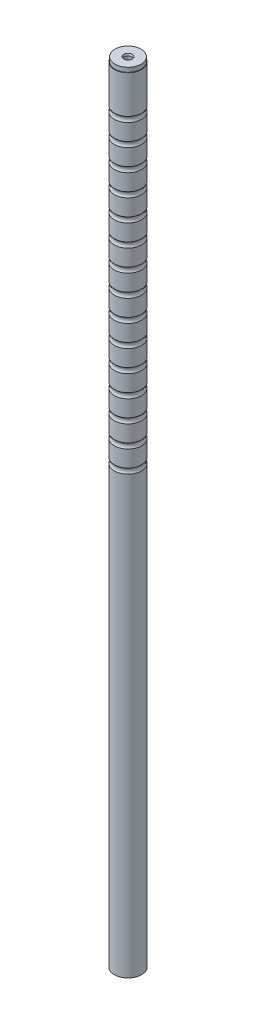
ISO-10303-21;
HEADER;
FILE_DESCRIPTION(('STEP AP214'),'2;1');
FILE_NAME('part.step','',(''),(''),'','','');
FILE_SCHEMA(('AUTOMOTIVE_DESIGN { 1 0 10303 214 1 1 1 1 }'));
ENDSEC;
DATA;
#1=APPLICATION_CONTEXT('core data for automotive mechanical design processes');
#2=APPLICATION_PROTOCOL_DEFINITION('international standard','automotive_design',2000,#1);
#3=PRODUCT_CONTEXT('',#1,'mechanical');
#4=PRODUCT('Part','Part','',(#3));
#5=PRODUCT_RELATED_PRODUCT_CATEGORY('part','',(#4));
#6=PRODUCT_DEFINITION_FORMATION('','',#4);
#7=PRODUCT_DEFINITION_CONTEXT('part definition',#1,'design');
#8=PRODUCT_DEFINITION('design','',#6,#7);
#9=PRODUCT_DEFINITION_SHAPE('','',#8);
#10=(LENGTH_UNIT() NAMED_UNIT(*) SI_UNIT(.MILLI.,.METRE.));
#11=(NAMED_UNIT(*) PLANE_ANGLE_UNIT() SI_UNIT($,.RADIAN.));
#12=(NAMED_UNIT(*) SI_UNIT($,.STERADIAN.) SOLID_ANGLE_UNIT());
#13=UNCERTAINTY_MEASURE_WITH_UNIT(LENGTH_MEASURE(1.E-05),#10,'distance_accuracy_value','');
#14=(GEOMETRIC_REPRESENTATION_CONTEXT(3) GLOBAL_UNCERTAINTY_ASSIGNED_CONTEXT((#13)) GLOBAL_UNIT_ASSIGNED_CONTEXT((#10,
#11,#12)) REPRESENTATION_CONTEXT('',''));
#15=CARTESIAN_POINT('',(0.,0.,0.));
#16=DIRECTION('',(0.,0.,1.));
#17=DIRECTION('',(1.,0.,0.));
#18=AXIS2_PLACEMENT_3D('',#15,#16,#17);
#19=CARTESIAN_POINT('',(0.,460.248,0.));
#20=DIRECTION('',(0.,-1.,0.));
#21=DIRECTION('',(0.,0.,-1.));
#22=AXIS2_PLACEMENT_3D('',#19,#20,#21);
#23=CYLINDRICAL_SURFACE('',#22,7.9375);
#24=CARTESIAN_POINT('',(0.,435.633629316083,0.));
#25=DIRECTION('',(0.,-1.,0.));
#26=DIRECTION('',(0.,0.,-1.));
#27=AXIS2_PLACEMENT_3D('',#24,#25,#26);
#28=CIRCLE('',#27,7.9375);
#29=CARTESIAN_POINT('',(0.,435.633629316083,-7.9375));
#30=VERTEX_POINT('',#29);
#31=EDGE_CURVE('E69',#30,#30,#28,.T.);
#32=CARTESIAN_POINT('',(0.,457.708,0.));
#33=DIRECTION('',(0.,1.,0.));
#34=DIRECTION('',(0.,0.,1.));
#35=AXIS2_PLACEMENT_3D('',#32,#33,#34);
#36=CIRCLE('',#35,7.9375);
#37=CARTESIAN_POINT('',(0.,457.708,-7.9375));
#38=VERTEX_POINT('',#37);
#39=EDGE_CURVE('E46',#38,#38,#36,.T.);
#40=CARTESIAN_POINT('',(0.,435.633629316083,-7.9375));
#41=CARTESIAN_POINT('',(0.,435.863570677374,-7.9375));
#42=CARTESIAN_POINT('',(0.,436.093512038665,-7.9375));
#43=CARTESIAN_POINT('',(0.,436.553394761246,-7.9375));
#44=CARTESIAN_POINT('',(0.,436.783336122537,-7.9375));
#45=CARTESIAN_POINT('',(0.,437.243218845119,-7.9375));
#46=CARTESIAN_POINT('',(0.,437.47316020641,-7.9375));
#47=CARTESIAN_POINT('',(0.,437.933042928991,-7.9375));
#48=CARTESIAN_POINT('',(0.,438.162984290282,-7.9375));
#49=CARTESIAN_POINT('',(0.,438.622867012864,-7.9375));
#50=CARTESIAN_POINT('',(0.,438.852808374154,-7.9375));
#51=CARTESIAN_POINT('',(0.,439.312691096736,-7.9375));
#52=CARTESIAN_POINT('',(0.,439.542632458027,-7.9375));
#53=CARTESIAN_POINT('',(0.,440.002515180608,-7.9375));
#54=CARTESIAN_POINT('',(0.,440.232456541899,-7.9375));
#55=CARTESIAN_POINT('',(0.,440.692339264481,-7.9375));
#56=CARTESIAN_POINT('',(0.,440.922280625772,-7.9375));
#57=CARTESIAN_POINT('',(0.,441.382163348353,-7.9375));
#58=CARTESIAN_POINT('',(0.,441.612104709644,-7.9375));
#59=CARTESIAN_POINT('',(0.,442.071987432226,-7.9375));
#60=CARTESIAN_POINT('',(0.,442.301928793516,-7.9375));
#61=CARTESIAN_POINT('',(0.,442.761811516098,-7.9375));
#62=CARTESIAN_POINT('',(0.,442.991752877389,-7.9375));
#63=CARTESIAN_POINT('',(0.,443.45163559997,-7.9375));
#64=CARTESIAN_POINT('',(0.,443.681576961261,-7.9375));
#65=CARTESIAN_POINT('',(0.,444.141459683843,-7.9375));
#66=CARTESIAN_POINT('',(0.,444.371401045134,-7.9375));
#67=CARTESIAN_POINT('',(0.,444.831283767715,-7.9375));
#68=CARTESIAN_POINT('',(0.,445.061225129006,-7.9375));
#69=CARTESIAN_POINT('',(0.,445.521107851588,-7.9375));
#70=CARTESIAN_POINT('',(0.,445.751049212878,-7.9375));
#71=CARTESIAN_POINT('',(0.,446.21093193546,-7.9375));
#72=CARTESIAN_POINT('',(0.,446.440873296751,-7.9375));
#73=CARTESIAN_POINT('',(0.,446.900756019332,-7.9375));
#74=CARTESIAN_POINT('',(0.,447.130697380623,-7.9375));
#75=CARTESIAN_POINT('',(0.,447.590580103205,-7.9375));
#76=CARTESIAN_POINT('',(0.,447.820521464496,-7.9375));
#77=CARTESIAN_POINT('',(0.,448.280404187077,-7.9375));
#78=CARTESIAN_POINT('',(0.,448.510345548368,-7.9375));
#79=CARTESIAN_POINT('',(0.,448.97022827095,-7.9375));
#80=CARTESIAN_POINT('',(0.,449.20016963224,-7.9375));
#81=CARTESIAN_POINT('',(0.,449.660052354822,-7.9375));
#82=CARTESIAN_POINT('',(0.,449.889993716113,-7.9375));
#83=CARTESIAN_POINT('',(0.,450.349876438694,-7.9375));
#84=CARTESIAN_POINT('',(0.,450.579817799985,-7.9375));
#85=CARTESIAN_POINT('',(0.,451.039700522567,-7.9375));
#86=CARTESIAN_POINT('',(0.,451.269641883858,-7.9375));
#87=CARTESIAN_POINT('',(0.,451.729524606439,-7.9375));
#88=CARTESIAN_POINT('',(0.,451.95946596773,-7.9375));
#89=CARTESIAN_POINT('',(0.,452.419348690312,-7.9375));
#90=CARTESIAN_POINT('',(0.,452.649290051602,-7.9375));
#91=CARTESIAN_POINT('',(0.,453.109172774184,-7.9375));
#92=CARTESIAN_POINT('',(0.,453.339114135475,-7.9375));
#93=CARTESIAN_POINT('',(0.,453.798996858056,-7.9375));
#94=CARTESIAN_POINT('',(0.,454.028938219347,-7.9375));
#95=CARTESIAN_POINT('',(0.,454.488820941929,-7.9375));
#96=CARTESIAN_POINT('',(0.,454.71876230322,-7.9375));
#97=CARTESIAN_POINT('',(0.,455.178645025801,-7.9375));
#98=CARTESIAN_POINT('',(0.,455.408586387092,-7.9375));
#99=CARTESIAN_POINT('',(0.,455.868469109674,-7.9375));
#100=CARTESIAN_POINT('',(0.,456.098410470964,-7.9375));
#101=CARTESIAN_POINT('',(0.,456.558293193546,-7.9375));
#102=CARTESIAN_POINT('',(0.,456.788234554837,-7.9375));
#103=CARTESIAN_POINT('',(0.,457.248117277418,-7.9375));
#104=CARTESIAN_POINT('',(0.,457.478058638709,-7.9375));
#105=CARTESIAN_POINT('',(0.,457.708,-7.9375));
#106=B_SPLINE_CURVE_WITH_KNOTS('',3,(#40,#41,#42,#43,#44,#45,#46,#47,#48,#49,#50,#51,#52,#53,
#54,#55,#56,#57,#58,#59,#60,#61,#62,#63,#64,#65,#66,#67,#68,#69,#70,#71,#72,#73,#74,#75,#76,#77,
#78,#79,#80,#81,#82,#83,#84,#85,#86,#87,#88,#89,#90,#91,#92,#93,#94,#95,#96,#97,#98,#99,#100,
#101,#102,#103,#104,#105),.UNSPECIFIED.,.F.,.F.,(4,2,2,2,2,2,2,2,2,2,2,2,2,2,2,2,2,2,2,2,2,2,2,
2,2,2,2,2,2,2,2,2,4),(0.,0.689824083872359,1.37964816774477,2.06947225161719,2.75929633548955,
3.44912041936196,4.13894450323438,4.82876858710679,5.51859267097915,6.20841675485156,
6.89824083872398,7.58806492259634,8.27788900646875,8.96771309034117,9.65753717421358,
10.3473612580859,11.0371853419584,11.7270094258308,12.4168335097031,13.1066575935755,
13.796481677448,14.4863057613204,15.1761298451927,15.8659539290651,16.5557780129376,
17.24560209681,17.9354261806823,18.6252502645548,19.3150743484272,20.0048984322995,
20.6947225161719,21.3845466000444,22.0743706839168),.UNSPECIFIED.);
#107=EDGE_CURVE('BSEAM43',#30,#38,#106,.T.);
#108=ORIENTED_EDGE('',*,*,#31,.F.);
#109=ORIENTED_EDGE('',*,*,#39,.F.);
#110=ORIENTED_EDGE('',*,*,#107,.T.);
#111=ORIENTED_EDGE('',*,*,#107,.F.);
#112=EDGE_LOOP('',(#108,#110,#109,#111));
#113=FACE_BOUND('',#112,.T.);
#114=ADVANCED_FACE('F43',(#113),#23,.T.);
#115=CARTESIAN_POINT('',(0.,267.438370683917,0.));
#116=DIRECTION('',(0.,1.,0.));
#117=DIRECTION('',(0.,0.,1.));
#118=AXIS2_PLACEMENT_3D('',#115,#116,#117);
#119=CIRCLE('',#118,7.9375);
#120=CARTESIAN_POINT('',(0.,267.438370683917,-7.9375));
#121=VERTEX_POINT('',#120);
#122=EDGE_CURVE('E166',#121,#121,#119,.T.);
#123=CARTESIAN_POINT('',(0.,257.833629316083,0.));
#124=DIRECTION('',(0.,-1.,0.));
#125=DIRECTION('',(0.,0.,-1.));
#126=AXIS2_PLACEMENT_3D('',#123,#124,#125);
#127=CIRCLE('',#126,7.9375);
#128=CARTESIAN_POINT('',(0.,257.833629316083,-7.9375));
#129=VERTEX_POINT('',#128);
#130=EDGE_CURVE('E169',#129,#129,#127,.T.);
#131=CARTESIAN_POINT('',(0.,267.438370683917,-7.9375));
#132=CARTESIAN_POINT('',(0.,267.338321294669,-7.9375));
#133=CARTESIAN_POINT('',(0.,267.23827190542,-7.9375));
#134=CARTESIAN_POINT('',(0.,267.038173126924,-7.9375));
#135=CARTESIAN_POINT('',(0.,266.938123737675,-7.9375));
#136=CARTESIAN_POINT('',(0.,266.738024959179,-7.9375));
#137=CARTESIAN_POINT('',(0.,266.637975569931,-7.9375));
#138=CARTESIAN_POINT('',(0.,266.437876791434,-7.9375));
#139=CARTESIAN_POINT('',(0.,266.337827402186,-7.9375));
#140=CARTESIAN_POINT('',(0.,266.137728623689,-7.9375));
#141=CARTESIAN_POINT('',(0.,266.037679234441,-7.9375));
#142=CARTESIAN_POINT('',(0.,265.837580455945,-7.9375));
#143=CARTESIAN_POINT('',(0.,265.737531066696,-7.9375));
#144=CARTESIAN_POINT('',(0.,265.5374322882,-7.9375));
#145=CARTESIAN_POINT('',(0.,265.437382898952,-7.9375));
#146=CARTESIAN_POINT('',(0.,265.237284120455,-7.9375));
#147=CARTESIAN_POINT('',(0.,265.137234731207,-7.9375));
#148=CARTESIAN_POINT('',(0.,264.93713595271,-7.9375));
#149=CARTESIAN_POINT('',(0.,264.837086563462,-7.9375));
#150=CARTESIAN_POINT('',(0.,264.636987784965,-7.9375));
#151=CARTESIAN_POINT('',(0.,264.536938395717,-7.9375));
#152=CARTESIAN_POINT('',(0.,264.336839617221,-7.9375));
#153=CARTESIAN_POINT('',(0.,264.236790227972,-7.9375));
#154=CARTESIAN_POINT('',(0.,264.036691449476,-7.9375));
#155=CARTESIAN_POINT('',(0.,263.936642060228,-7.9375));
#156=CARTESIAN_POINT('',(0.,263.736543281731,-7.9375));
#157=CARTESIAN_POINT('',(0.,263.636493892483,-7.9375));
#158=CARTESIAN_POINT('',(0.,263.436395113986,-7.9375));
#159=CARTESIAN_POINT('',(0.,263.336345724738,-7.9375));
#160=CARTESIAN_POINT('',(0.,263.136246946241,-7.9375));
#161=CARTESIAN_POINT('',(0.,263.036197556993,-7.9375));
#162=CARTESIAN_POINT('',(0.,262.836098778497,-7.9375));
#163=CARTESIAN_POINT('',(0.,262.736049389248,-7.9375));
#164=CARTESIAN_POINT('',(0.,262.535950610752,-7.9375));
#165=CARTESIAN_POINT('',(0.,262.435901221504,-7.9375));
#166=CARTESIAN_POINT('',(0.,262.235802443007,-7.9375));
#167=CARTESIAN_POINT('',(0.,262.135753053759,-7.9375));
#168=CARTESIAN_POINT('',(0.,261.935654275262,-7.9375));
#169=CARTESIAN_POINT('',(0.,261.835604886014,-7.9375));
#170=CARTESIAN_POINT('',(0.,261.635506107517,-7.9375));
#171=CARTESIAN_POINT('',(0.,261.535456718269,-7.9375));
#172=CARTESIAN_POINT('',(0.,261.335357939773,-7.9375));
#173=CARTESIAN_POINT('',(0.,261.235308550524,-7.9375));
#174=CARTESIAN_POINT('',(0.,261.035209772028,-7.9375));
#175=CARTESIAN_POINT('',(0.,260.935160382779,-7.9375));
#176=CARTESIAN_POINT('',(0.,260.735061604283,-7.9375));
#177=CARTESIAN_POINT('',(0.,260.635012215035,-7.9375));
#178=CARTESIAN_POINT('',(0.,260.434913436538,-7.9375));
#179=CARTESIAN_POINT('',(0.,260.33486404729,-7.9375));
#180=CARTESIAN_POINT('',(0.,260.134765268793,-7.9375));
#181=CARTESIAN_POINT('',(0.,260.034715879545,-7.9375));
#182=CARTESIAN_POINT('',(0.,259.834617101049,-7.9375));
#183=CARTESIAN_POINT('',(0.,259.7345677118,-7.9375));
#184=CARTESIAN_POINT('',(0.,259.534468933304,-7.9375));
#185=CARTESIAN_POINT('',(0.,259.434419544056,-7.9375));
#186=CARTESIAN_POINT('',(0.,259.234320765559,-7.9375));
#187=CARTESIAN_POINT('',(0.,259.134271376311,-7.9375));
#188=CARTESIAN_POINT('',(0.,258.934172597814,-7.9375));
#189=CARTESIAN_POINT('',(0.,258.834123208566,-7.9375));
#190=CARTESIAN_POINT('',(0.,258.634024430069,-7.9375));
#191=CARTESIAN_POINT('',(0.,258.533975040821,-7.9375));
#192=CARTESIAN_POINT('',(0.,258.333876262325,-7.9375));
#193=CARTESIAN_POINT('',(0.,258.233826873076,-7.9375));
#194=CARTESIAN_POINT('',(0.,258.03372809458,-7.9375));
#195=CARTESIAN_POINT('',(0.,257.933678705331,-7.9375));
#196=CARTESIAN_POINT('',(0.,257.833629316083,-7.9375));
#197=B_SPLINE_CURVE_WITH_KNOTS('',3,(#131,#132,#133,#134,#135,#136,#137,#138,#139,#140,#141,
#142,#143,#144,#145,#146,#147,#148,#149,#150,#151,#152,#153,#154,#155,#156,#157,#158,#159,#160,
#161,#162,#163,#164,#165,#166,#167,#168,#169,#170,#171,#172,#173,#174,#175,#176,#177,#178,#179,
#180,#181,#182,#183,#184,#185,#186,#187,#188,#189,#190,#191,#192,#193,#194,#195,#196),
.UNSPECIFIED.,.F.,.F.,(4,2,2,2,2,2,2,2,2,2,2,2,2,2,2,2,2,2,2,2,2,2,2,2,2,2,2,2,2,2,2,2,4),(0.,
0.300148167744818,0.600296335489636,0.900444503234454,1.20059267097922,1.50074083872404,
1.8008890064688,2.10103717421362,2.40118534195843,2.70133350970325,3.00148167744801,
3.30162984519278,3.6017780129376,3.90192618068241,4.20207434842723,4.50222251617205,
4.80237068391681,5.10251885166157,5.40266701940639,5.70281518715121,6.00296335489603,
6.30311152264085,6.60325969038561,6.90340785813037,7.20355602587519,7.50370419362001,
7.80385236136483,8.10400052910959,8.40414869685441,8.70429686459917,9.00444503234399,
9.30459320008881,9.60474136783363),.UNSPECIFIED.);
#198=EDGE_CURVE('BSEAM178',#121,#129,#197,.T.);
#199=ORIENTED_EDGE('',*,*,#122,.F.);
#200=ORIENTED_EDGE('',*,*,#130,.F.);
#201=ORIENTED_EDGE('',*,*,#198,.T.);
#202=ORIENTED_EDGE('',*,*,#198,.F.);
#203=EDGE_LOOP('',(#199,#201,#200,#202));
#204=FACE_BOUND('',#203,.T.);
#205=ADVANCED_FACE('F178',(#204),#23,.T.);
#206=CARTESIAN_POINT('',(0.,280.138370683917,0.));
#207=DIRECTION('',(0.,1.,0.));
#208=DIRECTION('',(0.,0.,1.));
#209=AXIS2_PLACEMENT_3D('',#206,#207,#208);
#210=CIRCLE('',#209,7.9375);
#211=CARTESIAN_POINT('',(0.,280.138370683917,-7.9375));
#212=VERTEX_POINT('',#211);
#213=EDGE_CURVE('E160',#212,#212,#210,.T.);
#214=CARTESIAN_POINT('',(0.,270.533629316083,0.));
#215=DIRECTION('',(0.,-1.,0.));
#216=DIRECTION('',(0.,0.,-1.));
#217=AXIS2_PLACEMENT_3D('',#214,#215,#216);
#218=CIRCLE('',#217,7.9375);
#219=CARTESIAN_POINT('',(0.,270.533629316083,-7.9375));
#220=VERTEX_POINT('',#219);
#221=EDGE_CURVE('E163',#220,#220,#218,.T.);
#222=CARTESIAN_POINT('',(0.,280.138370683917,-7.9375));
#223=CARTESIAN_POINT('',(0.,280.038321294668,-7.9375));
#224=CARTESIAN_POINT('',(0.,279.93827190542,-7.9375));
#225=CARTESIAN_POINT('',(0.,279.738173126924,-7.9375));
#226=CARTESIAN_POINT('',(0.,279.638123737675,-7.9375));
#227=CARTESIAN_POINT('',(0.,279.438024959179,-7.9375));
#228=CARTESIAN_POINT('',(0.,279.337975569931,-7.9375));
#229=CARTESIAN_POINT('',(0.,279.137876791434,-7.9375));
#230=CARTESIAN_POINT('',(0.,279.037827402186,-7.9375));
#231=CARTESIAN_POINT('',(0.,278.837728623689,-7.9375));
#232=CARTESIAN_POINT('',(0.,278.737679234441,-7.9375));
#233=CARTESIAN_POINT('',(0.,278.537580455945,-7.9375));
#234=CARTESIAN_POINT('',(0.,278.437531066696,-7.9375));
#235=CARTESIAN_POINT('',(0.,278.2374322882,-7.9375));
#236=CARTESIAN_POINT('',(0.,278.137382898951,-7.9375));
#237=CARTESIAN_POINT('',(0.,277.937284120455,-7.9375));
#238=CARTESIAN_POINT('',(0.,277.837234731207,-7.9375));
#239=CARTESIAN_POINT('',(0.,277.63713595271,-7.9375));
#240=CARTESIAN_POINT('',(0.,277.537086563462,-7.9375));
#241=CARTESIAN_POINT('',(0.,277.336987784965,-7.9375));
#242=CARTESIAN_POINT('',(0.,277.236938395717,-7.9375));
#243=CARTESIAN_POINT('',(0.,277.036839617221,-7.9375));
#244=CARTESIAN_POINT('',(0.,276.936790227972,-7.9375));
#245=CARTESIAN_POINT('',(0.,276.736691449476,-7.9375));
#246=CARTESIAN_POINT('',(0.,276.636642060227,-7.9375));
#247=CARTESIAN_POINT('',(0.,276.436543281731,-7.9375));
#248=CARTESIAN_POINT('',(0.,276.336493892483,-7.9375));
#249=CARTESIAN_POINT('',(0.,276.136395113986,-7.9375));
#250=CARTESIAN_POINT('',(0.,276.036345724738,-7.9375));
#251=CARTESIAN_POINT('',(0.,275.836246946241,-7.9375));
#252=CARTESIAN_POINT('',(0.,275.736197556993,-7.9375));
#253=CARTESIAN_POINT('',(0.,275.536098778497,-7.9375));
#254=CARTESIAN_POINT('',(0.,275.436049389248,-7.9375));
#255=CARTESIAN_POINT('',(0.,275.235950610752,-7.9375));
#256=CARTESIAN_POINT('',(0.,275.135901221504,-7.9375));
#257=CARTESIAN_POINT('',(0.,274.935802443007,-7.9375));
#258=CARTESIAN_POINT('',(0.,274.835753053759,-7.9375));
#259=CARTESIAN_POINT('',(0.,274.635654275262,-7.9375));
#260=CARTESIAN_POINT('',(0.,274.535604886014,-7.9375));
#261=CARTESIAN_POINT('',(0.,274.335506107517,-7.9375));
#262=CARTESIAN_POINT('',(0.,274.235456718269,-7.9375));
#263=CARTESIAN_POINT('',(0.,274.035357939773,-7.9375));
#264=CARTESIAN_POINT('',(0.,273.935308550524,-7.9375));
#265=CARTESIAN_POINT('',(0.,273.735209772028,-7.9375));
#266=CARTESIAN_POINT('',(0.,273.63516038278,-7.9375));
#267=CARTESIAN_POINT('',(0.,273.435061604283,-7.9375));
#268=CARTESIAN_POINT('',(0.,273.335012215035,-7.9375));
#269=CARTESIAN_POINT('',(0.,273.134913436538,-7.9375));
#270=CARTESIAN_POINT('',(0.,273.03486404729,-7.9375));
#271=CARTESIAN_POINT('',(0.,272.834765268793,-7.9375));
#272=CARTESIAN_POINT('',(0.,272.734715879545,-7.9375));
#273=CARTESIAN_POINT('',(0.,272.534617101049,-7.9375));
#274=CARTESIAN_POINT('',(0.,272.4345677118,-7.9375));
#275=CARTESIAN_POINT('',(0.,272.234468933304,-7.9375));
#276=CARTESIAN_POINT('',(0.,272.134419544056,-7.9375));
#277=CARTESIAN_POINT('',(0.,271.934320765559,-7.9375));
#278=CARTESIAN_POINT('',(0.,271.834271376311,-7.9375));
#279=CARTESIAN_POINT('',(0.,271.634172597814,-7.9375));
#280=CARTESIAN_POINT('',(0.,271.534123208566,-7.9375));
#281=CARTESIAN_POINT('',(0.,271.334024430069,-7.9375));
#282=CARTESIAN_POINT('',(0.,271.233975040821,-7.9375));
#283=CARTESIAN_POINT('',(0.,271.033876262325,-7.9375));
#284=CARTESIAN_POINT('',(0.,270.933826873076,-7.9375));
#285=CARTESIAN_POINT('',(0.,270.73372809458,-7.9375));
#286=CARTESIAN_POINT('',(0.,270.633678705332,-7.9375));
#287=CARTESIAN_POINT('',(0.,270.533629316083,-7.9375));
#288=B_SPLINE_CURVE_WITH_KNOTS('',3,(#222,#223,#224,#225,#226,#227,#228,#229,#230,#231,#232,
#233,#234,#235,#236,#237,#238,#239,#240,#241,#242,#243,#244,#245,#246,#247,#248,#249,#250,#251,
#252,#253,#254,#255,#256,#257,#258,#259,#260,#261,#262,#263,#264,#265,#266,#267,#268,#269,#270,
#271,#272,#273,#274,#275,#276,#277,#278,#279,#280,#281,#282,#283,#284,#285,#286,#287),
.UNSPECIFIED.,.F.,.F.,(4,2,2,2,2,2,2,2,2,2,2,2,2,2,2,2,2,2,2,2,2,2,2,2,2,2,2,2,2,2,2,2,4),(0.,
0.300148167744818,0.600296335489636,0.900444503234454,1.20059267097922,1.50074083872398,
1.8008890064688,2.10103717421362,2.40118534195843,2.7013335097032,3.00148167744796,
3.30162984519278,3.6017780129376,3.90192618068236,4.20207434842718,4.50222251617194,
4.80237068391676,5.10251885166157,5.40266701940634,5.70281518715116,6.00296335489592,
6.30311152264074,6.60325969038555,6.90340785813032,7.20355602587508,7.5037041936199,
7.80385236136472,8.10400052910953,8.4041486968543,8.70429686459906,9.00444503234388,
9.3045932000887,9.60474136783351),.UNSPECIFIED.);
#289=EDGE_CURVE('BSEAM180',#212,#220,#288,.T.);
#290=ORIENTED_EDGE('',*,*,#213,.F.);
#291=ORIENTED_EDGE('',*,*,#221,.F.);
#292=ORIENTED_EDGE('',*,*,#289,.T.);
#293=ORIENTED_EDGE('',*,*,#289,.F.);
#294=EDGE_LOOP('',(#290,#292,#291,#293));
#295=FACE_BOUND('',#294,.T.);
#296=ADVANCED_FACE('F180',(#295),#23,.T.);
#297=CARTESIAN_POINT('',(0.,292.838370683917,0.));
#298=DIRECTION('',(0.,1.,0.));
#299=DIRECTION('',(0.,0.,1.));
#300=AXIS2_PLACEMENT_3D('',#297,#298,#299);
#301=CIRCLE('',#300,7.9375);
#302=CARTESIAN_POINT('',(0.,292.838370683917,-7.9375));
#303=VERTEX_POINT('',#302);
#304=EDGE_CURVE('E154',#303,#303,#301,.T.);
#305=CARTESIAN_POINT('',(0.,283.233629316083,0.));
#306=DIRECTION('',(0.,-1.,0.));
#307=DIRECTION('',(0.,0.,-1.));
#308=AXIS2_PLACEMENT_3D('',#305,#306,#307);
#309=CIRCLE('',#308,7.9375);
#310=CARTESIAN_POINT('',(0.,283.233629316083,-7.9375));
#311=VERTEX_POINT('',#310);
#312=EDGE_CURVE('E157',#311,#311,#309,.T.);
#313=CARTESIAN_POINT('',(0.,292.838370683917,-7.9375));
#314=CARTESIAN_POINT('',(0.,292.738321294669,-7.9375));
#315=CARTESIAN_POINT('',(0.,292.63827190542,-7.9375));
#316=CARTESIAN_POINT('',(0.,292.438173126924,-7.9375));
#317=CARTESIAN_POINT('',(0.,292.338123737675,-7.9375));
#318=CARTESIAN_POINT('',(0.,292.138024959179,-7.9375));
#319=CARTESIAN_POINT('',(0.,292.037975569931,-7.9375));
#320=CARTESIAN_POINT('',(0.,291.837876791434,-7.9375));
#321=CARTESIAN_POINT('',(0.,291.737827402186,-7.9375));
#322=CARTESIAN_POINT('',(0.,291.537728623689,-7.9375));
#323=CARTESIAN_POINT('',(0.,291.437679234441,-7.9375));
#324=CARTESIAN_POINT('',(0.,291.237580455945,-7.9375));
#325=CARTESIAN_POINT('',(0.,291.137531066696,-7.9375));
#326=CARTESIAN_POINT('',(0.,290.9374322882,-7.9375));
#327=CARTESIAN_POINT('',(0.,290.837382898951,-7.9375));
#328=CARTESIAN_POINT('',(0.,290.637284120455,-7.9375));
#329=CARTESIAN_POINT('',(0.,290.537234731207,-7.9375));
#330=CARTESIAN_POINT('',(0.,290.33713595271,-7.9375));
#331=CARTESIAN_POINT('',(0.,290.237086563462,-7.9375));
#332=CARTESIAN_POINT('',(0.,290.036987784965,-7.9375));
#333=CARTESIAN_POINT('',(0.,289.936938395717,-7.9375));
#334=CARTESIAN_POINT('',(0.,289.736839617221,-7.9375));
#335=CARTESIAN_POINT('',(0.,289.636790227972,-7.9375));
#336=CARTESIAN_POINT('',(0.,289.436691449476,-7.9375));
#337=CARTESIAN_POINT('',(0.,289.336642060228,-7.9375));
#338=CARTESIAN_POINT('',(0.,289.136543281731,-7.9375));
#339=CARTESIAN_POINT('',(0.,289.036493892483,-7.9375));
#340=CARTESIAN_POINT('',(0.,288.836395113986,-7.9375));
#341=CARTESIAN_POINT('',(0.,288.736345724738,-7.9375));
#342=CARTESIAN_POINT('',(0.,288.536246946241,-7.9375));
#343=CARTESIAN_POINT('',(0.,288.436197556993,-7.9375));
#344=CARTESIAN_POINT('',(0.,288.236098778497,-7.9375));
#345=CARTESIAN_POINT('',(0.,288.136049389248,-7.9375));
#346=CARTESIAN_POINT('',(0.,287.935950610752,-7.9375));
#347=CARTESIAN_POINT('',(0.,287.835901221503,-7.9375));
#348=CARTESIAN_POINT('',(0.,287.635802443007,-7.9375));
#349=CARTESIAN_POINT('',(0.,287.535753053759,-7.9375));
#350=CARTESIAN_POINT('',(0.,287.335654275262,-7.9375));
#351=CARTESIAN_POINT('',(0.,287.235604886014,-7.9375));
#352=CARTESIAN_POINT('',(0.,287.035506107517,-7.9375));
#353=CARTESIAN_POINT('',(0.,286.935456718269,-7.9375));
#354=CARTESIAN_POINT('',(0.,286.735357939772,-7.9375));
#355=CARTESIAN_POINT('',(0.,286.635308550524,-7.9375));
#356=CARTESIAN_POINT('',(0.,286.435209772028,-7.9375));
#357=CARTESIAN_POINT('',(0.,286.335160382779,-7.9375));
#358=CARTESIAN_POINT('',(0.,286.135061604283,-7.9375));
#359=CARTESIAN_POINT('',(0.,286.035012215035,-7.9375));
#360=CARTESIAN_POINT('',(0.,285.834913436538,-7.9375));
#361=CARTESIAN_POINT('',(0.,285.73486404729,-7.9375));
#362=CARTESIAN_POINT('',(0.,285.534765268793,-7.9375));
#363=CARTESIAN_POINT('',(0.,285.434715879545,-7.9375));
#364=CARTESIAN_POINT('',(0.,285.234617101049,-7.9375));
#365=CARTESIAN_POINT('',(0.,285.1345677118,-7.9375));
#366=CARTESIAN_POINT('',(0.,284.934468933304,-7.9375));
#367=CARTESIAN_POINT('',(0.,284.834419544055,-7.9375));
#368=CARTESIAN_POINT('',(0.,284.634320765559,-7.9375));
#369=CARTESIAN_POINT('',(0.,284.534271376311,-7.9375));
#370=CARTESIAN_POINT('',(0.,284.334172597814,-7.9375));
#371=CARTESIAN_POINT('',(0.,284.234123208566,-7.9375));
#372=CARTESIAN_POINT('',(0.,284.034024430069,-7.9375));
#373=CARTESIAN_POINT('',(0.,283.933975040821,-7.9375));
#374=CARTESIAN_POINT('',(0.,283.733876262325,-7.9375));
#375=CARTESIAN_POINT('',(0.,283.633826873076,-7.9375));
#376=CARTESIAN_POINT('',(0.,283.43372809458,-7.9375));
#377=CARTESIAN_POINT('',(0.,283.333678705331,-7.9375));
#378=CARTESIAN_POINT('',(0.,283.233629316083,-7.9375));
#379=B_SPLINE_CURVE_WITH_KNOTS('',3,(#313,#314,#315,#316,#317,#318,#319,#320,#321,#322,#323,
#324,#325,#326,#327,#328,#329,#330,#331,#332,#333,#334,#335,#336,#337,#338,#339,#340,#341,#342,
#343,#344,#345,#346,#347,#348,#349,#350,#351,#352,#353,#354,#355,#356,#357,#358,#359,#360,#361,
#362,#363,#364,#365,#366,#367,#368,#369,#370,#371,#372,#373,#374,#375,#376,#377,#378),
.UNSPECIFIED.,.F.,.F.,(4,2,2,2,2,2,2,2,2,2,2,2,2,2,2,2,2,2,2,2,2,2,2,2,2,2,2,2,2,2,2,2,4),(0.,
0.300148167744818,0.600296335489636,0.900444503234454,1.20059267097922,1.50074083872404,
1.8008890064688,2.10103717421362,2.40118534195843,2.70133350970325,3.00148167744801,
3.30162984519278,3.6017780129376,3.90192618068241,4.20207434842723,4.50222251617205,
4.80237068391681,5.10251885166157,5.40266701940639,5.70281518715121,6.00296335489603,
6.30311152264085,6.60325969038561,6.90340785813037,7.20355602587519,7.50370419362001,
7.80385236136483,8.10400052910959,8.40414869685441,8.70429686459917,9.00444503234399,
9.30459320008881,9.60474136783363),.UNSPECIFIED.);
#380=EDGE_CURVE('BSEAM187',#303,#311,#379,.T.);
#381=ORIENTED_EDGE('',*,*,#304,.F.);
#382=ORIENTED_EDGE('',*,*,#312,.F.);
#383=ORIENTED_EDGE('',*,*,#380,.T.);
#384=ORIENTED_EDGE('',*,*,#380,.F.);
#385=EDGE_LOOP('',(#381,#383,#382,#384));
#386=FACE_BOUND('',#385,.T.);
#387=ADVANCED_FACE('F187',(#386),#23,.T.);
#388=CARTESIAN_POINT('',(0.,305.538370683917,0.));
#389=DIRECTION('',(0.,1.,0.));
#390=DIRECTION('',(0.,0.,1.));
#391=AXIS2_PLACEMENT_3D('',#388,#389,#390);
#392=CIRCLE('',#391,7.9375);
#393=CARTESIAN_POINT('',(0.,305.538370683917,-7.9375));
#394=VERTEX_POINT('',#393);
#395=EDGE_CURVE('E148',#394,#394,#392,.T.);
#396=CARTESIAN_POINT('',(0.,295.933629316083,0.));
#397=DIRECTION('',(0.,-1.,0.));
#398=DIRECTION('',(0.,0.,-1.));
#399=AXIS2_PLACEMENT_3D('',#396,#397,#398);
#400=CIRCLE('',#399,7.9375);
#401=CARTESIAN_POINT('',(0.,295.933629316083,-7.9375));
#402=VERTEX_POINT('',#401);
#403=EDGE_CURVE('E151',#402,#402,#400,.T.);
#404=CARTESIAN_POINT('',(0.,305.538370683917,-7.9375));
#405=CARTESIAN_POINT('',(0.,305.438321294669,-7.9375));
#406=CARTESIAN_POINT('',(0.,305.33827190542,-7.9375));
#407=CARTESIAN_POINT('',(0.,305.138173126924,-7.9375));
#408=CARTESIAN_POINT('',(0.,305.038123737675,-7.9375));
#409=CARTESIAN_POINT('',(0.,304.838024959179,-7.9375));
#410=CARTESIAN_POINT('',(0.,304.737975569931,-7.9375));
#411=CARTESIAN_POINT('',(0.,304.537876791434,-7.9375));
#412=CARTESIAN_POINT('',(0.,304.437827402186,-7.9375));
#413=CARTESIAN_POINT('',(0.,304.237728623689,-7.9375));
#414=CARTESIAN_POINT('',(0.,304.137679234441,-7.9375));
#415=CARTESIAN_POINT('',(0.,303.937580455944,-7.9375));
#416=CARTESIAN_POINT('',(0.,303.837531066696,-7.9375));
#417=CARTESIAN_POINT('',(0.,303.6374322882,-7.9375));
#418=CARTESIAN_POINT('',(0.,303.537382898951,-7.9375));
#419=CARTESIAN_POINT('',(0.,303.337284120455,-7.9375));
#420=CARTESIAN_POINT('',(0.,303.237234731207,-7.9375));
#421=CARTESIAN_POINT('',(0.,303.03713595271,-7.9375));
#422=CARTESIAN_POINT('',(0.,302.937086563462,-7.9375));
#423=CARTESIAN_POINT('',(0.,302.736987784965,-7.9375));
#424=CARTESIAN_POINT('',(0.,302.636938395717,-7.9375));
#425=CARTESIAN_POINT('',(0.,302.436839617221,-7.9375));
#426=CARTESIAN_POINT('',(0.,302.336790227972,-7.9375));
#427=CARTESIAN_POINT('',(0.,302.136691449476,-7.9375));
#428=CARTESIAN_POINT('',(0.,302.036642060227,-7.9375));
#429=CARTESIAN_POINT('',(0.,301.836543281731,-7.9375));
#430=CARTESIAN_POINT('',(0.,301.736493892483,-7.9375));
#431=CARTESIAN_POINT('',(0.,301.536395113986,-7.9375));
#432=CARTESIAN_POINT('',(0.,301.436345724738,-7.9375));
#433=CARTESIAN_POINT('',(0.,301.236246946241,-7.9375));
#434=CARTESIAN_POINT('',(0.,301.136197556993,-7.9375));
#435=CARTESIAN_POINT('',(0.,300.936098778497,-7.9375));
#436=CARTESIAN_POINT('',(0.,300.836049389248,-7.9375));
#437=CARTESIAN_POINT('',(0.,300.635950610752,-7.9375));
#438=CARTESIAN_POINT('',(0.,300.535901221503,-7.9375));
#439=CARTESIAN_POINT('',(0.,300.335802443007,-7.9375));
#440=CARTESIAN_POINT('',(0.,300.235753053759,-7.9375));
#441=CARTESIAN_POINT('',(0.,300.035654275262,-7.9375));
#442=CARTESIAN_POINT('',(0.,299.935604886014,-7.9375));
#443=CARTESIAN_POINT('',(0.,299.735506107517,-7.9375));
#444=CARTESIAN_POINT('',(0.,299.635456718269,-7.9375));
#445=CARTESIAN_POINT('',(0.,299.435357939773,-7.9375));
#446=CARTESIAN_POINT('',(0.,299.335308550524,-7.9375));
#447=CARTESIAN_POINT('',(0.,299.135209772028,-7.9375));
#448=CARTESIAN_POINT('',(0.,299.03516038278,-7.9375));
#449=CARTESIAN_POINT('',(0.,298.835061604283,-7.9375));
#450=CARTESIAN_POINT('',(0.,298.735012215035,-7.9375));
#451=CARTESIAN_POINT('',(0.,298.534913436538,-7.9375));
#452=CARTESIAN_POINT('',(0.,298.43486404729,-7.9375));
#453=CARTESIAN_POINT('',(0.,298.234765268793,-7.9375));
#454=CARTESIAN_POINT('',(0.,298.134715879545,-7.9375));
#455=CARTESIAN_POINT('',(0.,297.934617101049,-7.9375));
#456=CARTESIAN_POINT('',(0.,297.8345677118,-7.9375));
#457=CARTESIAN_POINT('',(0.,297.634468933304,-7.9375));
#458=CARTESIAN_POINT('',(0.,297.534419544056,-7.9375));
#459=CARTESIAN_POINT('',(0.,297.334320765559,-7.9375));
#460=CARTESIAN_POINT('',(0.,297.234271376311,-7.9375));
#461=CARTESIAN_POINT('',(0.,297.034172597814,-7.9375));
#462=CARTESIAN_POINT('',(0.,296.934123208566,-7.9375));
#463=CARTESIAN_POINT('',(0.,296.734024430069,-7.9375));
#464=CARTESIAN_POINT('',(0.,296.633975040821,-7.9375));
#465=CARTESIAN_POINT('',(0.,296.433876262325,-7.9375));
#466=CARTESIAN_POINT('',(0.,296.333826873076,-7.9375));
#467=CARTESIAN_POINT('',(0.,296.13372809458,-7.9375));
#468=CARTESIAN_POINT('',(0.,296.033678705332,-7.9375));
#469=CARTESIAN_POINT('',(0.,295.933629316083,-7.9375));
#470=B_SPLINE_CURVE_WITH_KNOTS('',3,(#404,#405,#406,#407,#408,#409,#410,#411,#412,#413,#414,
#415,#416,#417,#418,#419,#420,#421,#422,#423,#424,#425,#426,#427,#428,#429,#430,#431,#432,#433,
#434,#435,#436,#437,#438,#439,#440,#441,#442,#443,#444,#445,#446,#447,#448,#449,#450,#451,#452,
#453,#454,#455,#456,#457,#458,#459,#460,#461,#462,#463,#464,#465,#466,#467,#468,#469),
.UNSPECIFIED.,.F.,.F.,(4,2,2,2,2,2,2,2,2,2,2,2,2,2,2,2,2,2,2,2,2,2,2,2,2,2,2,2,2,2,2,2,4),(0.,
0.300148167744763,0.600296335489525,0.900444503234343,1.20059267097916,1.50074083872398,
1.8008890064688,2.10103717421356,2.40118534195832,2.70133350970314,3.00148167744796,
3.30162984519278,3.60177801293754,3.9019261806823,4.20207434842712,4.50222251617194,
4.80237068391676,5.10251885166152,5.40266701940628,5.7028151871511,6.00296335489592,
6.30311152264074,6.60325969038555,6.90340785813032,7.20355602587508,7.5037041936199,
7.80385236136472,8.10400052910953,8.4041486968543,8.70429686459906,9.00444503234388,
9.3045932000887,9.60474136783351),.UNSPECIFIED.);
#471=EDGE_CURVE('BSEAM433',#394,#402,#470,.T.);
#472=ORIENTED_EDGE('',*,*,#395,.F.);
#473=ORIENTED_EDGE('',*,*,#403,.F.);
#474=ORIENTED_EDGE('',*,*,#471,.T.);
#475=ORIENTED_EDGE('',*,*,#471,.F.);
#476=EDGE_LOOP('',(#472,#474,#473,#475));
#477=FACE_BOUND('',#476,.T.);
#478=ADVANCED_FACE('F433',(#477),#23,.T.);
#479=CARTESIAN_POINT('',(0.,318.238370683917,0.));
#480=DIRECTION('',(0.,1.,0.));
#481=DIRECTION('',(0.,0.,1.));
#482=AXIS2_PLACEMENT_3D('',#479,#480,#481);
#483=CIRCLE('',#482,7.9375);
#484=CARTESIAN_POINT('',(0.,318.238370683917,-7.9375));
#485=VERTEX_POINT('',#484);
#486=EDGE_CURVE('E142',#485,#485,#483,.T.);
#487=CARTESIAN_POINT('',(0.,308.633629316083,0.));
#488=DIRECTION('',(0.,-1.,0.));
#489=DIRECTION('',(0.,0.,-1.));
#490=AXIS2_PLACEMENT_3D('',#487,#488,#489);
#491=CIRCLE('',#490,7.9375);
#492=CARTESIAN_POINT('',(0.,308.633629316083,-7.9375));
#493=VERTEX_POINT('',#492);
#494=EDGE_CURVE('E145',#493,#493,#491,.T.);
#495=CARTESIAN_POINT('',(0.,318.238370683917,-7.9375));
#496=CARTESIAN_POINT('',(0.,318.138321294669,-7.9375));
#497=CARTESIAN_POINT('',(0.,318.03827190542,-7.9375));
#498=CARTESIAN_POINT('',(0.,317.838173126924,-7.9375));
#499=CARTESIAN_POINT('',(0.,317.738123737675,-7.9375));
#500=CARTESIAN_POINT('',(0.,317.538024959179,-7.9375));
#501=CARTESIAN_POINT('',(0.,317.437975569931,-7.9375));
#502=CARTESIAN_POINT('',(0.,317.237876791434,-7.9375));
#503=CARTESIAN_POINT('',(0.,317.137827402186,-7.9375));
#504=CARTESIAN_POINT('',(0.,316.937728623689,-7.9375));
#505=CARTESIAN_POINT('',(0.,316.837679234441,-7.9375));
#506=CARTESIAN_POINT('',(0.,316.637580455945,-7.9375));
#507=CARTESIAN_POINT('',(0.,316.537531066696,-7.9375));
#508=CARTESIAN_POINT('',(0.,316.3374322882,-7.9375));
#509=CARTESIAN_POINT('',(0.,316.237382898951,-7.9375));
#510=CARTESIAN_POINT('',(0.,316.037284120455,-7.9375));
#511=CARTESIAN_POINT('',(0.,315.937234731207,-7.9375));
#512=CARTESIAN_POINT('',(0.,315.73713595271,-7.9375));
#513=CARTESIAN_POINT('',(0.,315.637086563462,-7.9375));
#514=CARTESIAN_POINT('',(0.,315.436987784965,-7.9375));
#515=CARTESIAN_POINT('',(0.,315.336938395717,-7.9375));
#516=CARTESIAN_POINT('',(0.,315.136839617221,-7.9375));
#517=CARTESIAN_POINT('',(0.,315.036790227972,-7.9375));
#518=CARTESIAN_POINT('',(0.,314.836691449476,-7.9375));
#519=CARTESIAN_POINT('',(0.,314.736642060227,-7.9375));
#520=CARTESIAN_POINT('',(0.,314.536543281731,-7.9375));
#521=CARTESIAN_POINT('',(0.,314.436493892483,-7.9375));
#522=CARTESIAN_POINT('',(0.,314.236395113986,-7.9375));
#523=CARTESIAN_POINT('',(0.,314.136345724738,-7.9375));
#524=CARTESIAN_POINT('',(0.,313.936246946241,-7.9375));
#525=CARTESIAN_POINT('',(0.,313.836197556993,-7.9375));
#526=CARTESIAN_POINT('',(0.,313.636098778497,-7.9375));
#527=CARTESIAN_POINT('',(0.,313.536049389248,-7.9375));
#528=CARTESIAN_POINT('',(0.,313.335950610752,-7.9375));
#529=CARTESIAN_POINT('',(0.,313.235901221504,-7.9375));
#530=CARTESIAN_POINT('',(0.,313.035802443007,-7.9375));
#531=CARTESIAN_POINT('',(0.,312.935753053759,-7.9375));
#532=CARTESIAN_POINT('',(0.,312.735654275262,-7.9375));
#533=CARTESIAN_POINT('',(0.,312.635604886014,-7.9375));
#534=CARTESIAN_POINT('',(0.,312.435506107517,-7.9375));
#535=CARTESIAN_POINT('',(0.,312.335456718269,-7.9375));
#536=CARTESIAN_POINT('',(0.,312.135357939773,-7.9375));
#537=CARTESIAN_POINT('',(0.,312.035308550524,-7.9375));
#538=CARTESIAN_POINT('',(0.,311.835209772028,-7.9375));
#539=CARTESIAN_POINT('',(0.,311.73516038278,-7.9375));
#540=CARTESIAN_POINT('',(0.,311.535061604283,-7.9375));
#541=CARTESIAN_POINT('',(0.,311.435012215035,-7.9375));
#542=CARTESIAN_POINT('',(0.,311.234913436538,-7.9375));
#543=CARTESIAN_POINT('',(0.,311.13486404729,-7.9375));
#544=CARTESIAN_POINT('',(0.,310.934765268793,-7.9375));
#545=CARTESIAN_POINT('',(0.,310.834715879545,-7.9375));
#546=CARTESIAN_POINT('',(0.,310.634617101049,-7.9375));
#547=CARTESIAN_POINT('',(0.,310.5345677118,-7.9375));
#548=CARTESIAN_POINT('',(0.,310.334468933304,-7.9375));
#549=CARTESIAN_POINT('',(0.,310.234419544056,-7.9375));
#550=CARTESIAN_POINT('',(0.,310.034320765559,-7.9375));
#551=CARTESIAN_POINT('',(0.,309.934271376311,-7.9375));
#552=CARTESIAN_POINT('',(0.,309.734172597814,-7.9375));
#553=CARTESIAN_POINT('',(0.,309.634123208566,-7.9375));
#554=CARTESIAN_POINT('',(0.,309.434024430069,-7.9375));
#555=CARTESIAN_POINT('',(0.,309.333975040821,-7.9375));
#556=CARTESIAN_POINT('',(0.,309.133876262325,-7.9375));
#557=CARTESIAN_POINT('',(0.,309.033826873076,-7.9375));
#558=CARTESIAN_POINT('',(0.,308.83372809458,-7.9375));
#559=CARTESIAN_POINT('',(0.,308.733678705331,-7.9375));
#560=CARTESIAN_POINT('',(0.,308.633629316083,-7.9375));
#561=B_SPLINE_CURVE_WITH_KNOTS('',3,(#495,#496,#497,#498,#499,#500,#501,#502,#503,#504,#505,
#506,#507,#508,#509,#510,#511,#512,#513,#514,#515,#516,#517,#518,#519,#520,#521,#522,#523,#524,
#525,#526,#527,#528,#529,#530,#531,#532,#533,#534,#535,#536,#537,#538,#539,#540,#541,#542,#543,
#544,#545,#546,#547,#548,#549,#550,#551,#552,#553,#554,#555,#556,#557,#558,#559,#560),
.UNSPECIFIED.,.F.,.F.,(4,2,2,2,2,2,2,2,2,2,2,2,2,2,2,2,2,2,2,2,2,2,2,2,2,2,2,2,2,2,2,2,4),(0.,
0.300148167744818,0.600296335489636,0.900444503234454,1.20059267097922,1.50074083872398,
1.8008890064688,2.10103717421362,2.40118534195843,2.7013335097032,3.00148167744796,
3.30162984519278,3.6017780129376,3.90192618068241,4.20207434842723,4.50222251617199,
4.80237068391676,5.10251885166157,5.40266701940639,5.70281518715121,6.00296335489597,
6.30311152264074,6.60325969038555,6.90340785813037,7.20355602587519,7.50370419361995,
7.80385236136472,8.10400052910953,8.40414869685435,8.70429686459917,9.00444503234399,
9.30459320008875,9.60474136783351),.UNSPECIFIED.);
#562=EDGE_CURVE('BSEAM425',#485,#493,#561,.T.);
#563=ORIENTED_EDGE('',*,*,#486,.F.);
#564=ORIENTED_EDGE('',*,*,#494,.F.);
#565=ORIENTED_EDGE('',*,*,#562,.T.);
#566=ORIENTED_EDGE('',*,*,#562,.F.);
#567=EDGE_LOOP('',(#563,#565,#564,#566));
#568=FACE_BOUND('',#567,.T.);
#569=ADVANCED_FACE('F425',(#568),#23,.T.);
#570=CARTESIAN_POINT('',(0.,330.938370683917,0.));
#571=DIRECTION('',(0.,1.,0.));
#572=DIRECTION('',(0.,0.,1.));
#573=AXIS2_PLACEMENT_3D('',#570,#571,#572);
#574=CIRCLE('',#573,7.9375);
#575=CARTESIAN_POINT('',(0.,330.938370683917,-7.9375));
#576=VERTEX_POINT('',#575);
#577=EDGE_CURVE('E136',#576,#576,#574,.T.);
#578=CARTESIAN_POINT('',(0.,321.333629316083,0.));
#579=DIRECTION('',(0.,-1.,0.));
#580=DIRECTION('',(0.,0.,-1.));
#581=AXIS2_PLACEMENT_3D('',#578,#579,#580);
#582=CIRCLE('',#581,7.9375);
#583=CARTESIAN_POINT('',(0.,321.333629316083,-7.9375));
#584=VERTEX_POINT('',#583);
#585=EDGE_CURVE('E139',#584,#584,#582,.T.);
#586=CARTESIAN_POINT('',(0.,330.938370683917,-7.9375));
#587=CARTESIAN_POINT('',(0.,330.838321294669,-7.9375));
#588=CARTESIAN_POINT('',(0.,330.73827190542,-7.9375));
#589=CARTESIAN_POINT('',(0.,330.538173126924,-7.9375));
#590=CARTESIAN_POINT('',(0.,330.438123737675,-7.9375));
#591=CARTESIAN_POINT('',(0.,330.238024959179,-7.9375));
#592=CARTESIAN_POINT('',(0.,330.137975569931,-7.9375));
#593=CARTESIAN_POINT('',(0.,329.937876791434,-7.9375));
#594=CARTESIAN_POINT('',(0.,329.837827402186,-7.9375));
#595=CARTESIAN_POINT('',(0.,329.637728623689,-7.9375));
#596=CARTESIAN_POINT('',(0.,329.537679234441,-7.9375));
#597=CARTESIAN_POINT('',(0.,329.337580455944,-7.9375));
#598=CARTESIAN_POINT('',(0.,329.237531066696,-7.9375));
#599=CARTESIAN_POINT('',(0.,329.0374322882,-7.9375));
#600=CARTESIAN_POINT('',(0.,328.937382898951,-7.9375));
#601=CARTESIAN_POINT('',(0.,328.737284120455,-7.9375));
#602=CARTESIAN_POINT('',(0.,328.637234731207,-7.9375));
#603=CARTESIAN_POINT('',(0.,328.43713595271,-7.9375));
#604=CARTESIAN_POINT('',(0.,328.337086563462,-7.9375));
#605=CARTESIAN_POINT('',(0.,328.136987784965,-7.9375));
#606=CARTESIAN_POINT('',(0.,328.036938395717,-7.9375));
#607=CARTESIAN_POINT('',(0.,327.836839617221,-7.9375));
#608=CARTESIAN_POINT('',(0.,327.736790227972,-7.9375));
#609=CARTESIAN_POINT('',(0.,327.536691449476,-7.9375));
#610=CARTESIAN_POINT('',(0.,327.436642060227,-7.9375));
#611=CARTESIAN_POINT('',(0.,327.236543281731,-7.9375));
#612=CARTESIAN_POINT('',(0.,327.136493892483,-7.9375));
#613=CARTESIAN_POINT('',(0.,326.936395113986,-7.9375));
#614=CARTESIAN_POINT('',(0.,326.836345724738,-7.9375));
#615=CARTESIAN_POINT('',(0.,326.636246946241,-7.9375));
#616=CARTESIAN_POINT('',(0.,326.536197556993,-7.9375));
#617=CARTESIAN_POINT('',(0.,326.336098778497,-7.9375));
#618=CARTESIAN_POINT('',(0.,326.236049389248,-7.9375));
#619=CARTESIAN_POINT('',(0.,326.035950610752,-7.9375));
#620=CARTESIAN_POINT('',(0.,325.935901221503,-7.9375));
#621=CARTESIAN_POINT('',(0.,325.735802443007,-7.9375));
#622=CARTESIAN_POINT('',(0.,325.635753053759,-7.9375));
#623=CARTESIAN_POINT('',(0.,325.435654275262,-7.9375));
#624=CARTESIAN_POINT('',(0.,325.335604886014,-7.9375));
#625=CARTESIAN_POINT('',(0.,325.135506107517,-7.9375));
#626=CARTESIAN_POINT('',(0.,325.035456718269,-7.9375));
#627=CARTESIAN_POINT('',(0.,324.835357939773,-7.9375));
#628=CARTESIAN_POINT('',(0.,324.735308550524,-7.9375));
#629=CARTESIAN_POINT('',(0.,324.535209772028,-7.9375));
#630=CARTESIAN_POINT('',(0.,324.435160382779,-7.9375));
#631=CARTESIAN_POINT('',(0.,324.235061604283,-7.9375));
#632=CARTESIAN_POINT('',(0.,324.135012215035,-7.9375));
#633=CARTESIAN_POINT('',(0.,323.934913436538,-7.9375));
#634=CARTESIAN_POINT('',(0.,323.83486404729,-7.9375));
#635=CARTESIAN_POINT('',(0.,323.634765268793,-7.9375));
#636=CARTESIAN_POINT('',(0.,323.534715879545,-7.9375));
#637=CARTESIAN_POINT('',(0.,323.334617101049,-7.9375));
#638=CARTESIAN_POINT('',(0.,323.2345677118,-7.9375));
#639=CARTESIAN_POINT('',(0.,323.034468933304,-7.9375));
#640=CARTESIAN_POINT('',(0.,322.934419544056,-7.9375));
#641=CARTESIAN_POINT('',(0.,322.734320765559,-7.9375));
#642=CARTESIAN_POINT('',(0.,322.634271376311,-7.9375));
#643=CARTESIAN_POINT('',(0.,322.434172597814,-7.9375));
#644=CARTESIAN_POINT('',(0.,322.334123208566,-7.9375));
#645=CARTESIAN_POINT('',(0.,322.134024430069,-7.9375));
#646=CARTESIAN_POINT('',(0.,322.033975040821,-7.9375));
#647=CARTESIAN_POINT('',(0.,321.833876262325,-7.9375));
#648=CARTESIAN_POINT('',(0.,321.733826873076,-7.9375));
#649=CARTESIAN_POINT('',(0.,321.53372809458,-7.9375));
#650=CARTESIAN_POINT('',(0.,321.433678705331,-7.9375));
#651=CARTESIAN_POINT('',(0.,321.333629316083,-7.9375));
#652=B_SPLINE_CURVE_WITH_KNOTS('',3,(#586,#587,#588,#589,#590,#591,#592,#593,#594,#595,#596,
#597,#598,#599,#600,#601,#602,#603,#604,#605,#606,#607,#608,#609,#610,#611,#612,#613,#614,#615,
#616,#617,#618,#619,#620,#621,#622,#623,#624,#625,#626,#627,#628,#629,#630,#631,#632,#633,#634,
#635,#636,#637,#638,#639,#640,#641,#642,#643,#644,#645,#646,#647,#648,#649,#650,#651),
.UNSPECIFIED.,.F.,.F.,(4,2,2,2,2,2,2,2,2,2,2,2,2,2,2,2,2,2,2,2,2,2,2,2,2,2,2,2,2,2,2,2,4),(0.,
0.300148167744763,0.600296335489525,0.900444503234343,1.20059267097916,1.50074083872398,
1.8008890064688,2.10103717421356,2.40118534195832,2.70133350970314,3.00148167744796,
3.30162984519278,3.60177801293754,3.9019261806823,4.20207434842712,4.50222251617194,
4.80237068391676,5.10251885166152,5.40266701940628,5.7028151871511,6.00296335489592,
6.30311152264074,6.60325969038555,6.90340785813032,7.20355602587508,7.5037041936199,
7.80385236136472,8.10400052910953,8.4041486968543,8.70429686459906,9.00444503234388,
9.3045932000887,9.60474136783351),.UNSPECIFIED.);
#653=EDGE_CURVE('BSEAM417',#576,#584,#652,.T.);
#654=ORIENTED_EDGE('',*,*,#577,.F.);
#655=ORIENTED_EDGE('',*,*,#585,.F.);
#656=ORIENTED_EDGE('',*,*,#653,.T.);
#657=ORIENTED_EDGE('',*,*,#653,.F.);
#658=EDGE_LOOP('',(#654,#656,#655,#657));
#659=FACE_BOUND('',#658,.T.);
#660=ADVANCED_FACE('F417',(#659),#23,.T.);
#661=CARTESIAN_POINT('',(0.,343.638370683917,0.));
#662=DIRECTION('',(0.,1.,0.));
#663=DIRECTION('',(0.,0.,1.));
#664=AXIS2_PLACEMENT_3D('',#661,#662,#663);
#665=CIRCLE('',#664,7.9375);
#666=CARTESIAN_POINT('',(0.,343.638370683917,-7.9375));
#667=VERTEX_POINT('',#666);
#668=EDGE_CURVE('E130',#667,#667,#665,.T.);
#669=CARTESIAN_POINT('',(0.,334.033629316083,0.));
#670=DIRECTION('',(0.,-1.,0.));
#671=DIRECTION('',(0.,0.,-1.));
#672=AXIS2_PLACEMENT_3D('',#669,#670,#671);
#673=CIRCLE('',#672,7.9375);
#674=CARTESIAN_POINT('',(0.,334.033629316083,-7.9375));
#675=VERTEX_POINT('',#674);
#676=EDGE_CURVE('E133',#675,#675,#673,.T.);
#677=CARTESIAN_POINT('',(0.,343.638370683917,-7.9375));
#678=CARTESIAN_POINT('',(0.,343.538321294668,-7.9375));
#679=CARTESIAN_POINT('',(0.,343.43827190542,-7.9375));
#680=CARTESIAN_POINT('',(0.,343.238173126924,-7.9375));
#681=CARTESIAN_POINT('',(0.,343.138123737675,-7.9375));
#682=CARTESIAN_POINT('',(0.,342.938024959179,-7.9375));
#683=CARTESIAN_POINT('',(0.,342.837975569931,-7.9375));
#684=CARTESIAN_POINT('',(0.,342.637876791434,-7.9375));
#685=CARTESIAN_POINT('',(0.,342.537827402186,-7.9375));
#686=CARTESIAN_POINT('',(0.,342.337728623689,-7.9375));
#687=CARTESIAN_POINT('',(0.,342.237679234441,-7.9375));
#688=CARTESIAN_POINT('',(0.,342.037580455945,-7.9375));
#689=CARTESIAN_POINT('',(0.,341.937531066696,-7.9375));
#690=CARTESIAN_POINT('',(0.,341.7374322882,-7.9375));
#691=CARTESIAN_POINT('',(0.,341.637382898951,-7.9375));
#692=CARTESIAN_POINT('',(0.,341.437284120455,-7.9375));
#693=CARTESIAN_POINT('',(0.,341.337234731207,-7.9375));
#694=CARTESIAN_POINT('',(0.,341.13713595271,-7.9375));
#695=CARTESIAN_POINT('',(0.,341.037086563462,-7.9375));
#696=CARTESIAN_POINT('',(0.,340.836987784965,-7.9375));
#697=CARTESIAN_POINT('',(0.,340.736938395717,-7.9375));
#698=CARTESIAN_POINT('',(0.,340.53683961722,-7.9375));
#699=CARTESIAN_POINT('',(0.,340.436790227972,-7.9375));
#700=CARTESIAN_POINT('',(0.,340.236691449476,-7.9375));
#701=CARTESIAN_POINT('',(0.,340.136642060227,-7.9375));
#702=CARTESIAN_POINT('',(0.,339.936543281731,-7.9375));
#703=CARTESIAN_POINT('',(0.,339.836493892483,-7.9375));
#704=CARTESIAN_POINT('',(0.,339.636395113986,-7.9375));
#705=CARTESIAN_POINT('',(0.,339.536345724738,-7.9375));
#706=CARTESIAN_POINT('',(0.,339.336246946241,-7.9375));
#707=CARTESIAN_POINT('',(0.,339.236197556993,-7.9375));
#708=CARTESIAN_POINT('',(0.,339.036098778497,-7.9375));
#709=CARTESIAN_POINT('',(0.,338.936049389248,-7.9375));
#710=CARTESIAN_POINT('',(0.,338.735950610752,-7.9375));
#711=CARTESIAN_POINT('',(0.,338.635901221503,-7.9375));
#712=CARTESIAN_POINT('',(0.,338.435802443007,-7.9375));
#713=CARTESIAN_POINT('',(0.,338.335753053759,-7.9375));
#714=CARTESIAN_POINT('',(0.,338.135654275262,-7.9375));
#715=CARTESIAN_POINT('',(0.,338.035604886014,-7.9375));
#716=CARTESIAN_POINT('',(0.,337.835506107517,-7.9375));
#717=CARTESIAN_POINT('',(0.,337.735456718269,-7.9375));
#718=CARTESIAN_POINT('',(0.,337.535357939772,-7.9375));
#719=CARTESIAN_POINT('',(0.,337.435308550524,-7.9375));
#720=CARTESIAN_POINT('',(0.,337.235209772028,-7.9375));
#721=CARTESIAN_POINT('',(0.,337.135160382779,-7.9375));
#722=CARTESIAN_POINT('',(0.,336.935061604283,-7.9375));
#723=CARTESIAN_POINT('',(0.,336.835012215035,-7.9375));
#724=CARTESIAN_POINT('',(0.,336.634913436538,-7.9375));
#725=CARTESIAN_POINT('',(0.,336.53486404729,-7.9375));
#726=CARTESIAN_POINT('',(0.,336.334765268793,-7.9375));
#727=CARTESIAN_POINT('',(0.,336.234715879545,-7.9375));
#728=CARTESIAN_POINT('',(0.,336.034617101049,-7.9375));
#729=CARTESIAN_POINT('',(0.,335.9345677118,-7.9375));
#730=CARTESIAN_POINT('',(0.,335.734468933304,-7.9375));
#731=CARTESIAN_POINT('',(0.,335.634419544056,-7.9375));
#732=CARTESIAN_POINT('',(0.,335.434320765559,-7.9375));
#733=CARTESIAN_POINT('',(0.,335.334271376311,-7.9375));
#734=CARTESIAN_POINT('',(0.,335.134172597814,-7.9375));
#735=CARTESIAN_POINT('',(0.,335.034123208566,-7.9375));
#736=CARTESIAN_POINT('',(0.,334.834024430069,-7.9375));
#737=CARTESIAN_POINT('',(0.,334.733975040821,-7.9375));
#738=CARTESIAN_POINT('',(0.,334.533876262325,-7.9375));
#739=CARTESIAN_POINT('',(0.,334.433826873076,-7.9375));
#740=CARTESIAN_POINT('',(0.,334.23372809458,-7.9375));
#741=CARTESIAN_POINT('',(0.,334.133678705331,-7.9375));
#742=CARTESIAN_POINT('',(0.,334.033629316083,-7.9375));
#743=B_SPLINE_CURVE_WITH_KNOTS('',3,(#677,#678,#679,#680,#681,#682,#683,#684,#685,#686,#687,
#688,#689,#690,#691,#692,#693,#694,#695,#696,#697,#698,#699,#700,#701,#702,#703,#704,#705,#706,
#707,#708,#709,#710,#711,#712,#713,#714,#715,#716,#717,#718,#719,#720,#721,#722,#723,#724,#725,
#726,#727,#728,#729,#730,#731,#732,#733,#734,#735,#736,#737,#738,#739,#740,#741,#742),
.UNSPECIFIED.,.F.,.F.,(4,2,2,2,2,2,2,2,2,2,2,2,2,2,2,2,2,2,2,2,2,2,2,2,2,2,2,2,2,2,2,2,4),(0.,
0.300148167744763,0.600296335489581,0.900444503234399,1.20059267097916,1.50074083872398,
1.80088900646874,2.10103717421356,2.40118534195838,2.70133350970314,3.00148167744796,
3.30162984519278,3.60177801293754,3.90192618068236,4.20207434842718,4.50222251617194,
4.80237068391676,5.10251885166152,5.40266701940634,5.70281518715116,6.00296335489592,
6.30311152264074,6.6032596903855,6.90340785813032,7.20355602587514,7.5037041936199,
7.80385236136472,8.10400052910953,8.4041486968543,8.70429686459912,9.00444503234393,
9.3045932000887,9.60474136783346),.UNSPECIFIED.);
#744=EDGE_CURVE('BSEAM409',#667,#675,#743,.T.);
#745=ORIENTED_EDGE('',*,*,#668,.F.);
#746=ORIENTED_EDGE('',*,*,#676,.F.);
#747=ORIENTED_EDGE('',*,*,#744,.T.);
#748=ORIENTED_EDGE('',*,*,#744,.F.);
#749=EDGE_LOOP('',(#745,#747,#746,#748));
#750=FACE_BOUND('',#749,.T.);
#751=ADVANCED_FACE('F409',(#750),#23,.T.);
#752=CARTESIAN_POINT('',(0.,356.338370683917,0.));
#753=DIRECTION('',(0.,1.,0.));
#754=DIRECTION('',(0.,0.,1.));
#755=AXIS2_PLACEMENT_3D('',#752,#753,#754);
#756=CIRCLE('',#755,7.9375);
#757=CARTESIAN_POINT('',(0.,356.338370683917,-7.9375));
#758=VERTEX_POINT('',#757);
#759=EDGE_CURVE('E124',#758,#758,#756,.T.);
#760=CARTESIAN_POINT('',(0.,346.733629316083,0.));
#761=DIRECTION('',(0.,-1.,0.));
#762=DIRECTION('',(0.,0.,-1.));
#763=AXIS2_PLACEMENT_3D('',#760,#761,#762);
#764=CIRCLE('',#763,7.9375);
#765=CARTESIAN_POINT('',(0.,346.733629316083,-7.9375));
#766=VERTEX_POINT('',#765);
#767=EDGE_CURVE('E127',#766,#766,#764,.T.);
#768=CARTESIAN_POINT('',(0.,356.338370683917,-7.9375));
#769=CARTESIAN_POINT('',(0.,356.238321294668,-7.9375));
#770=CARTESIAN_POINT('',(0.,356.13827190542,-7.9375));
#771=CARTESIAN_POINT('',(0.,355.938173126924,-7.9375));
#772=CARTESIAN_POINT('',(0.,355.838123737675,-7.9375));
#773=CARTESIAN_POINT('',(0.,355.638024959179,-7.9375));
#774=CARTESIAN_POINT('',(0.,355.537975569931,-7.9375));
#775=CARTESIAN_POINT('',(0.,355.337876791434,-7.9375));
#776=CARTESIAN_POINT('',(0.,355.237827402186,-7.9375));
#777=CARTESIAN_POINT('',(0.,355.037728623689,-7.9375));
#778=CARTESIAN_POINT('',(0.,354.937679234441,-7.9375));
#779=CARTESIAN_POINT('',(0.,354.737580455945,-7.9375));
#780=CARTESIAN_POINT('',(0.,354.637531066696,-7.9375));
#781=CARTESIAN_POINT('',(0.,354.4374322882,-7.9375));
#782=CARTESIAN_POINT('',(0.,354.337382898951,-7.9375));
#783=CARTESIAN_POINT('',(0.,354.137284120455,-7.9375));
#784=CARTESIAN_POINT('',(0.,354.037234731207,-7.9375));
#785=CARTESIAN_POINT('',(0.,353.83713595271,-7.9375));
#786=CARTESIAN_POINT('',(0.,353.737086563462,-7.9375));
#787=CARTESIAN_POINT('',(0.,353.536987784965,-7.9375));
#788=CARTESIAN_POINT('',(0.,353.436938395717,-7.9375));
#789=CARTESIAN_POINT('',(0.,353.236839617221,-7.9375));
#790=CARTESIAN_POINT('',(0.,353.136790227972,-7.9375));
#791=CARTESIAN_POINT('',(0.,352.936691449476,-7.9375));
#792=CARTESIAN_POINT('',(0.,352.836642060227,-7.9375));
#793=CARTESIAN_POINT('',(0.,352.636543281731,-7.9375));
#794=CARTESIAN_POINT('',(0.,352.536493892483,-7.9375));
#795=CARTESIAN_POINT('',(0.,352.336395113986,-7.9375));
#796=CARTESIAN_POINT('',(0.,352.236345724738,-7.9375));
#797=CARTESIAN_POINT('',(0.,352.036246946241,-7.9375));
#798=CARTESIAN_POINT('',(0.,351.936197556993,-7.9375));
#799=CARTESIAN_POINT('',(0.,351.736098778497,-7.9375));
#800=CARTESIAN_POINT('',(0.,351.636049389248,-7.9375));
#801=CARTESIAN_POINT('',(0.,351.435950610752,-7.9375));
#802=CARTESIAN_POINT('',(0.,351.335901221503,-7.9375));
#803=CARTESIAN_POINT('',(0.,351.135802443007,-7.9375));
#804=CARTESIAN_POINT('',(0.,351.035753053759,-7.9375));
#805=CARTESIAN_POINT('',(0.,350.835654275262,-7.9375));
#806=CARTESIAN_POINT('',(0.,350.735604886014,-7.9375));
#807=CARTESIAN_POINT('',(0.,350.535506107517,-7.9375));
#808=CARTESIAN_POINT('',(0.,350.435456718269,-7.9375));
#809=CARTESIAN_POINT('',(0.,350.235357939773,-7.9375));
#810=CARTESIAN_POINT('',(0.,350.135308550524,-7.9375));
#811=CARTESIAN_POINT('',(0.,349.935209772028,-7.9375));
#812=CARTESIAN_POINT('',(0.,349.83516038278,-7.9375));
#813=CARTESIAN_POINT('',(0.,349.635061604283,-7.9375));
#814=CARTESIAN_POINT('',(0.,349.535012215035,-7.9375));
#815=CARTESIAN_POINT('',(0.,349.334913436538,-7.9375));
#816=CARTESIAN_POINT('',(0.,349.23486404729,-7.9375));
#817=CARTESIAN_POINT('',(0.,349.034765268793,-7.9375));
#818=CARTESIAN_POINT('',(0.,348.934715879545,-7.9375));
#819=CARTESIAN_POINT('',(0.,348.734617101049,-7.9375));
#820=CARTESIAN_POINT('',(0.,348.6345677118,-7.9375));
#821=CARTESIAN_POINT('',(0.,348.434468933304,-7.9375));
#822=CARTESIAN_POINT('',(0.,348.334419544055,-7.9375));
#823=CARTESIAN_POINT('',(0.,348.134320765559,-7.9375));
#824=CARTESIAN_POINT('',(0.,348.034271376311,-7.9375));
#825=CARTESIAN_POINT('',(0.,347.834172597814,-7.9375));
#826=CARTESIAN_POINT('',(0.,347.734123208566,-7.9375));
#827=CARTESIAN_POINT('',(0.,347.534024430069,-7.9375));
#828=CARTESIAN_POINT('',(0.,347.433975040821,-7.9375));
#829=CARTESIAN_POINT('',(0.,347.233876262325,-7.9375));
#830=CARTESIAN_POINT('',(0.,347.133826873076,-7.9375));
#831=CARTESIAN_POINT('',(0.,346.93372809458,-7.9375));
#832=CARTESIAN_POINT('',(0.,346.833678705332,-7.9375));
#833=CARTESIAN_POINT('',(0.,346.733629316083,-7.9375));
#834=B_SPLINE_CURVE_WITH_KNOTS('',3,(#768,#769,#770,#771,#772,#773,#774,#775,#776,#777,#778,
#779,#780,#781,#782,#783,#784,#785,#786,#787,#788,#789,#790,#791,#792,#793,#794,#795,#796,#797,
#798,#799,#800,#801,#802,#803,#804,#805,#806,#807,#808,#809,#810,#811,#812,#813,#814,#815,#816,
#817,#818,#819,#820,#821,#822,#823,#824,#825,#826,#827,#828,#829,#830,#831,#832,#833),
.UNSPECIFIED.,.F.,.F.,(4,2,2,2,2,2,2,2,2,2,2,2,2,2,2,2,2,2,2,2,2,2,2,2,2,2,2,2,2,2,2,2,4),(0.,
0.300148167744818,0.600296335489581,0.900444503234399,1.20059267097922,1.50074083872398,
1.8008890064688,2.10103717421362,2.40118534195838,2.7013335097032,3.00148167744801,
3.30162984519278,3.6017780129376,3.90192618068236,4.20207434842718,4.50222251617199,
4.80237068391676,5.10251885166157,5.40266701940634,5.70281518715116,6.00296335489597,
6.30311152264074,6.60325969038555,6.90340785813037,7.20355602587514,7.50370419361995,
7.80385236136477,8.10400052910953,8.40414869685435,8.70429686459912,9.00444503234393,
9.30459320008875,9.60474136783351),.UNSPECIFIED.);
#835=EDGE_CURVE('BSEAM401',#758,#766,#834,.T.);
#836=ORIENTED_EDGE('',*,*,#759,.F.);
#837=ORIENTED_EDGE('',*,*,#767,.F.);
#838=ORIENTED_EDGE('',*,*,#835,.T.);
#839=ORIENTED_EDGE('',*,*,#835,.F.);
#840=EDGE_LOOP('',(#836,#838,#837,#839));
#841=FACE_BOUND('',#840,.T.);
#842=ADVANCED_FACE('F401',(#841),#23,.T.);
#843=CARTESIAN_POINT('',(0.,369.038370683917,0.));
#844=DIRECTION('',(0.,1.,0.));
#845=DIRECTION('',(0.,0.,1.));
#846=AXIS2_PLACEMENT_3D('',#843,#844,#845);
#847=CIRCLE('',#846,7.9375);
#848=CARTESIAN_POINT('',(0.,369.038370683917,-7.9375));
#849=VERTEX_POINT('',#848);
#850=EDGE_CURVE('E118',#849,#849,#847,.T.);
#851=CARTESIAN_POINT('',(0.,359.433629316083,0.));
#852=DIRECTION('',(0.,-1.,0.));
#853=DIRECTION('',(0.,0.,-1.));
#854=AXIS2_PLACEMENT_3D('',#851,#852,#853);
#855=CIRCLE('',#854,7.9375);
#856=CARTESIAN_POINT('',(0.,359.433629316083,-7.9375));
#857=VERTEX_POINT('',#856);
#858=EDGE_CURVE('E121',#857,#857,#855,.T.);
#859=CARTESIAN_POINT('',(0.,369.038370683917,-7.9375));
#860=CARTESIAN_POINT('',(0.,368.938321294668,-7.9375));
#861=CARTESIAN_POINT('',(0.,368.83827190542,-7.9375));
#862=CARTESIAN_POINT('',(0.,368.638173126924,-7.9375));
#863=CARTESIAN_POINT('',(0.,368.538123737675,-7.9375));
#864=CARTESIAN_POINT('',(0.,368.338024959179,-7.9375));
#865=CARTESIAN_POINT('',(0.,368.237975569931,-7.9375));
#866=CARTESIAN_POINT('',(0.,368.037876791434,-7.9375));
#867=CARTESIAN_POINT('',(0.,367.937827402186,-7.9375));
#868=CARTESIAN_POINT('',(0.,367.737728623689,-7.9375));
#869=CARTESIAN_POINT('',(0.,367.637679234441,-7.9375));
#870=CARTESIAN_POINT('',(0.,367.437580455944,-7.9375));
#871=CARTESIAN_POINT('',(0.,367.337531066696,-7.9375));
#872=CARTESIAN_POINT('',(0.,367.1374322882,-7.9375));
#873=CARTESIAN_POINT('',(0.,367.037382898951,-7.9375));
#874=CARTESIAN_POINT('',(0.,366.837284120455,-7.9375));
#875=CARTESIAN_POINT('',(0.,366.737234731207,-7.9375));
#876=CARTESIAN_POINT('',(0.,366.53713595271,-7.9375));
#877=CARTESIAN_POINT('',(0.,366.437086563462,-7.9375));
#878=CARTESIAN_POINT('',(0.,366.236987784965,-7.9375));
#879=CARTESIAN_POINT('',(0.,366.136938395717,-7.9375));
#880=CARTESIAN_POINT('',(0.,365.93683961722,-7.9375));
#881=CARTESIAN_POINT('',(0.,365.836790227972,-7.9375));
#882=CARTESIAN_POINT('',(0.,365.636691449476,-7.9375));
#883=CARTESIAN_POINT('',(0.,365.536642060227,-7.9375));
#884=CARTESIAN_POINT('',(0.,365.336543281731,-7.9375));
#885=CARTESIAN_POINT('',(0.,365.236493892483,-7.9375));
#886=CARTESIAN_POINT('',(0.,365.036395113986,-7.9375));
#887=CARTESIAN_POINT('',(0.,364.936345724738,-7.9375));
#888=CARTESIAN_POINT('',(0.,364.736246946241,-7.9375));
#889=CARTESIAN_POINT('',(0.,364.636197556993,-7.9375));
#890=CARTESIAN_POINT('',(0.,364.436098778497,-7.9375));
#891=CARTESIAN_POINT('',(0.,364.336049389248,-7.9375));
#892=CARTESIAN_POINT('',(0.,364.135950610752,-7.9375));
#893=CARTESIAN_POINT('',(0.,364.035901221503,-7.9375));
#894=CARTESIAN_POINT('',(0.,363.835802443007,-7.9375));
#895=CARTESIAN_POINT('',(0.,363.735753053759,-7.9375));
#896=CARTESIAN_POINT('',(0.,363.535654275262,-7.9375));
#897=CARTESIAN_POINT('',(0.,363.435604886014,-7.9375));
#898=CARTESIAN_POINT('',(0.,363.235506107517,-7.9375));
#899=CARTESIAN_POINT('',(0.,363.135456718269,-7.9375));
#900=CARTESIAN_POINT('',(0.,362.935357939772,-7.9375));
#901=CARTESIAN_POINT('',(0.,362.835308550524,-7.9375));
#902=CARTESIAN_POINT('',(0.,362.635209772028,-7.9375));
#903=CARTESIAN_POINT('',(0.,362.535160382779,-7.9375));
#904=CARTESIAN_POINT('',(0.,362.335061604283,-7.9375));
#905=CARTESIAN_POINT('',(0.,362.235012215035,-7.9375));
#906=CARTESIAN_POINT('',(0.,362.034913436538,-7.9375));
#907=CARTESIAN_POINT('',(0.,361.93486404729,-7.9375));
#908=CARTESIAN_POINT('',(0.,361.734765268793,-7.9375));
#909=CARTESIAN_POINT('',(0.,361.634715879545,-7.9375));
#910=CARTESIAN_POINT('',(0.,361.434617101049,-7.9375));
#911=CARTESIAN_POINT('',(0.,361.3345677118,-7.9375));
#912=CARTESIAN_POINT('',(0.,361.134468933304,-7.9375));
#913=CARTESIAN_POINT('',(0.,361.034419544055,-7.9375));
#914=CARTESIAN_POINT('',(0.,360.834320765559,-7.9375));
#915=CARTESIAN_POINT('',(0.,360.734271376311,-7.9375));
#916=CARTESIAN_POINT('',(0.,360.534172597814,-7.9375));
#917=CARTESIAN_POINT('',(0.,360.434123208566,-7.9375));
#918=CARTESIAN_POINT('',(0.,360.234024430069,-7.9375));
#919=CARTESIAN_POINT('',(0.,360.133975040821,-7.9375));
#920=CARTESIAN_POINT('',(0.,359.933876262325,-7.9375));
#921=CARTESIAN_POINT('',(0.,359.833826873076,-7.9375));
#922=CARTESIAN_POINT('',(0.,359.63372809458,-7.9375));
#923=CARTESIAN_POINT('',(0.,359.533678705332,-7.9375));
#924=CARTESIAN_POINT('',(0.,359.433629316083,-7.9375));
#925=B_SPLINE_CURVE_WITH_KNOTS('',3,(#859,#860,#861,#862,#863,#864,#865,#866,#867,#868,#869,
#870,#871,#872,#873,#874,#875,#876,#877,#878,#879,#880,#881,#882,#883,#884,#885,#886,#887,#888,
#889,#890,#891,#892,#893,#894,#895,#896,#897,#898,#899,#900,#901,#902,#903,#904,#905,#906,#907,
#908,#909,#910,#911,#912,#913,#914,#915,#916,#917,#918,#919,#920,#921,#922,#923,#924),
.UNSPECIFIED.,.F.,.F.,(4,2,2,2,2,2,2,2,2,2,2,2,2,2,2,2,2,2,2,2,2,2,2,2,2,2,2,2,2,2,2,2,4),(0.,
0.300148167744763,0.600296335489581,0.900444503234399,1.20059267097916,1.50074083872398,
1.80088900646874,2.10103717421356,2.40118534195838,2.70133350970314,3.00148167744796,
3.30162984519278,3.60177801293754,3.90192618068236,4.20207434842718,4.50222251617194,
4.80237068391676,5.10251885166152,5.40266701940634,5.70281518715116,6.00296335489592,
6.30311152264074,6.6032596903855,6.90340785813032,7.20355602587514,7.5037041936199,
7.80385236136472,8.10400052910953,8.4041486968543,8.70429686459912,9.00444503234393,
9.3045932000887,9.60474136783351),.UNSPECIFIED.);
#926=EDGE_CURVE('BSEAM393',#849,#857,#925,.T.);
#927=ORIENTED_EDGE('',*,*,#850,.F.);
#928=ORIENTED_EDGE('',*,*,#858,.F.);
#929=ORIENTED_EDGE('',*,*,#926,.T.);
#930=ORIENTED_EDGE('',*,*,#926,.F.);
#931=EDGE_LOOP('',(#927,#929,#928,#930));
#932=FACE_BOUND('',#931,.T.);
#933=ADVANCED_FACE('F393',(#932),#23,.T.);
#934=CARTESIAN_POINT('',(0.,381.738370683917,0.));
#935=DIRECTION('',(0.,1.,0.));
#936=DIRECTION('',(0.,0.,1.));
#937=AXIS2_PLACEMENT_3D('',#934,#935,#936);
#938=CIRCLE('',#937,7.9375);
#939=CARTESIAN_POINT('',(0.,381.738370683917,-7.9375));
#940=VERTEX_POINT('',#939);
#941=EDGE_CURVE('E112',#940,#940,#938,.T.);
#942=CARTESIAN_POINT('',(0.,372.133629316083,0.));
#943=DIRECTION('',(0.,-1.,0.));
#944=DIRECTION('',(0.,0.,-1.));
#945=AXIS2_PLACEMENT_3D('',#942,#943,#944);
#946=CIRCLE('',#945,7.9375);
#947=CARTESIAN_POINT('',(0.,372.133629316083,-7.9375));
#948=VERTEX_POINT('',#947);
#949=EDGE_CURVE('E115',#948,#948,#946,.T.);
#950=CARTESIAN_POINT('',(0.,381.738370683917,-7.9375));
#951=CARTESIAN_POINT('',(0.,381.638321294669,-7.9375));
#952=CARTESIAN_POINT('',(0.,381.53827190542,-7.9375));
#953=CARTESIAN_POINT('',(0.,381.338173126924,-7.9375));
#954=CARTESIAN_POINT('',(0.,381.238123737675,-7.9375));
#955=CARTESIAN_POINT('',(0.,381.038024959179,-7.9375));
#956=CARTESIAN_POINT('',(0.,380.937975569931,-7.9375));
#957=CARTESIAN_POINT('',(0.,380.737876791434,-7.9375));
#958=CARTESIAN_POINT('',(0.,380.637827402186,-7.9375));
#959=CARTESIAN_POINT('',(0.,380.437728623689,-7.9375));
#960=CARTESIAN_POINT('',(0.,380.337679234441,-7.9375));
#961=CARTESIAN_POINT('',(0.,380.137580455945,-7.9375));
#962=CARTESIAN_POINT('',(0.,380.037531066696,-7.9375));
#963=CARTESIAN_POINT('',(0.,379.8374322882,-7.9375));
#964=CARTESIAN_POINT('',(0.,379.737382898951,-7.9375));
#965=CARTESIAN_POINT('',(0.,379.537284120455,-7.9375));
#966=CARTESIAN_POINT('',(0.,379.437234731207,-7.9375));
#967=CARTESIAN_POINT('',(0.,379.23713595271,-7.9375));
#968=CARTESIAN_POINT('',(0.,379.137086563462,-7.9375));
#969=CARTESIAN_POINT('',(0.,378.936987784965,-7.9375));
#970=CARTESIAN_POINT('',(0.,378.836938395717,-7.9375));
#971=CARTESIAN_POINT('',(0.,378.636839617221,-7.9375));
#972=CARTESIAN_POINT('',(0.,378.536790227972,-7.9375));
#973=CARTESIAN_POINT('',(0.,378.336691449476,-7.9375));
#974=CARTESIAN_POINT('',(0.,378.236642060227,-7.9375));
#975=CARTESIAN_POINT('',(0.,378.036543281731,-7.9375));
#976=CARTESIAN_POINT('',(0.,377.936493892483,-7.9375));
#977=CARTESIAN_POINT('',(0.,377.736395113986,-7.9375));
#978=CARTESIAN_POINT('',(0.,377.636345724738,-7.9375));
#979=CARTESIAN_POINT('',(0.,377.436246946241,-7.9375));
#980=CARTESIAN_POINT('',(0.,377.336197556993,-7.9375));
#981=CARTESIAN_POINT('',(0.,377.136098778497,-7.9375));
#982=CARTESIAN_POINT('',(0.,377.036049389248,-7.9375));
#983=CARTESIAN_POINT('',(0.,376.835950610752,-7.9375));
#984=CARTESIAN_POINT('',(0.,376.735901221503,-7.9375));
#985=CARTESIAN_POINT('',(0.,376.535802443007,-7.9375));
#986=CARTESIAN_POINT('',(0.,376.435753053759,-7.9375));
#987=CARTESIAN_POINT('',(0.,376.235654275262,-7.9375));
#988=CARTESIAN_POINT('',(0.,376.135604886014,-7.9375));
#989=CARTESIAN_POINT('',(0.,375.935506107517,-7.9375));
#990=CARTESIAN_POINT('',(0.,375.835456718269,-7.9375));
#991=CARTESIAN_POINT('',(0.,375.635357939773,-7.9375));
#992=CARTESIAN_POINT('',(0.,375.535308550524,-7.9375));
#993=CARTESIAN_POINT('',(0.,375.335209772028,-7.9375));
#994=CARTESIAN_POINT('',(0.,375.235160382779,-7.9375));
#995=CARTESIAN_POINT('',(0.,375.035061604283,-7.9375));
#996=CARTESIAN_POINT('',(0.,374.935012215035,-7.9375));
#997=CARTESIAN_POINT('',(0.,374.734913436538,-7.9375));
#998=CARTESIAN_POINT('',(0.,374.63486404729,-7.9375));
#999=CARTESIAN_POINT('',(0.,374.434765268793,-7.9375));
#1000=CARTESIAN_POINT('',(0.,374.334715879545,-7.9375));
#1001=CARTESIAN_POINT('',(0.,374.134617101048,-7.9375));
#1002=CARTESIAN_POINT('',(0.,374.0345677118,-7.9375));
#1003=CARTESIAN_POINT('',(0.,373.834468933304,-7.9375));
#1004=CARTESIAN_POINT('',(0.,373.734419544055,-7.9375));
#1005=CARTESIAN_POINT('',(0.,373.534320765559,-7.9375));
#1006=CARTESIAN_POINT('',(0.,373.434271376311,-7.9375));
#1007=CARTESIAN_POINT('',(0.,373.234172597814,-7.9375));
#1008=CARTESIAN_POINT('',(0.,373.134123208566,-7.9375));
#1009=CARTESIAN_POINT('',(0.,372.934024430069,-7.9375));
#1010=CARTESIAN_POINT('',(0.,372.833975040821,-7.9375));
#1011=CARTESIAN_POINT('',(0.,372.633876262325,-7.9375));
#1012=CARTESIAN_POINT('',(0.,372.533826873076,-7.9375));
#1013=CARTESIAN_POINT('',(0.,372.33372809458,-7.9375));
#1014=CARTESIAN_POINT('',(0.,372.233678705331,-7.9375));
#1015=CARTESIAN_POINT('',(0.,372.133629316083,-7.9375));
#1016=B_SPLINE_CURVE_WITH_KNOTS('',3,(#950,#951,#952,#953,#954,#955,#956,#957,#958,#959,#960,
#961,#962,#963,#964,#965,#966,#967,#968,#969,#970,#971,#972,#973,#974,#975,#976,#977,#978,#979,
#980,#981,#982,#983,#984,#985,#986,#987,#988,#989,#990,#991,#992,#993,#994,#995,#996,#997,#998,
#999,#1000,#1001,#1002,#1003,#1004,#1005,#1006,#1007,#1008,#1009,#1010,#1011,#1012,#1013,#1014,
#1015),.UNSPECIFIED.,.F.,.F.,(4,2,2,2,2,2,2,2,2,2,2,2,2,2,2,2,2,2,2,2,2,2,2,2,2,2,2,2,2,2,2,2,
4),(0.,0.300148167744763,0.600296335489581,0.900444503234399,1.20059267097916,1.50074083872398,
1.80088900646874,2.10103717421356,2.40118534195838,2.7013335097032,3.00148167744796,
3.30162984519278,3.60177801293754,3.90192618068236,4.20207434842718,4.50222251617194,
4.80237068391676,5.10251885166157,5.40266701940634,5.70281518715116,6.00296335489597,
6.30311152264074,6.60325969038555,6.90340785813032,7.20355602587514,7.50370419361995,
7.80385236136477,8.10400052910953,8.40414869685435,8.70429686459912,9.00444503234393,
9.30459320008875,9.60474136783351),.UNSPECIFIED.);
#1017=EDGE_CURVE('BSEAM385',#940,#948,#1016,.T.);
#1018=ORIENTED_EDGE('',*,*,#941,.F.);
#1019=ORIENTED_EDGE('',*,*,#949,.F.);
#1020=ORIENTED_EDGE('',*,*,#1017,.T.);
#1021=ORIENTED_EDGE('',*,*,#1017,.F.);
#1022=EDGE_LOOP('',(#1018,#1020,#1019,#1021));
#1023=FACE_BOUND('',#1022,.T.);
#1024=ADVANCED_FACE('F385',(#1023),#23,.T.);
#1025=CARTESIAN_POINT('',(0.,394.438370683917,0.));
#1026=DIRECTION('',(0.,1.,0.));
#1027=DIRECTION('',(0.,0.,1.));
#1028=AXIS2_PLACEMENT_3D('',#1025,#1026,#1027);
#1029=CIRCLE('',#1028,7.9375);
#1030=CARTESIAN_POINT('',(0.,394.438370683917,-7.9375));
#1031=VERTEX_POINT('',#1030);
#1032=EDGE_CURVE('E106',#1031,#1031,#1029,.T.);
#1033=CARTESIAN_POINT('',(0.,384.833629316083,0.));
#1034=DIRECTION('',(0.,-1.,0.));
#1035=DIRECTION('',(0.,0.,-1.));
#1036=AXIS2_PLACEMENT_3D('',#1033,#1034,#1035);
#1037=CIRCLE('',#1036,7.9375);
#1038=CARTESIAN_POINT('',(0.,384.833629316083,-7.9375));
#1039=VERTEX_POINT('',#1038);
#1040=EDGE_CURVE('E109',#1039,#1039,#1037,.T.);
#1041=CARTESIAN_POINT('',(0.,394.438370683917,-7.9375));
#1042=CARTESIAN_POINT('',(0.,394.338321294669,-7.9375));
#1043=CARTESIAN_POINT('',(0.,394.23827190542,-7.9375));
#1044=CARTESIAN_POINT('',(0.,394.038173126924,-7.9375));
#1045=CARTESIAN_POINT('',(0.,393.938123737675,-7.9375));
#1046=CARTESIAN_POINT('',(0.,393.738024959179,-7.9375));
#1047=CARTESIAN_POINT('',(0.,393.637975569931,-7.9375));
#1048=CARTESIAN_POINT('',(0.,393.437876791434,-7.9375));
#1049=CARTESIAN_POINT('',(0.,393.337827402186,-7.9375));
#1050=CARTESIAN_POINT('',(0.,393.137728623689,-7.9375));
#1051=CARTESIAN_POINT('',(0.,393.037679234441,-7.9375));
#1052=CARTESIAN_POINT('',(0.,392.837580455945,-7.9375));
#1053=CARTESIAN_POINT('',(0.,392.737531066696,-7.9375));
#1054=CARTESIAN_POINT('',(0.,392.5374322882,-7.9375));
#1055=CARTESIAN_POINT('',(0.,392.437382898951,-7.9375));
#1056=CARTESIAN_POINT('',(0.,392.237284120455,-7.9375));
#1057=CARTESIAN_POINT('',(0.,392.137234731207,-7.9375));
#1058=CARTESIAN_POINT('',(0.,391.93713595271,-7.9375));
#1059=CARTESIAN_POINT('',(0.,391.837086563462,-7.9375));
#1060=CARTESIAN_POINT('',(0.,391.636987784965,-7.9375));
#1061=CARTESIAN_POINT('',(0.,391.536938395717,-7.9375));
#1062=CARTESIAN_POINT('',(0.,391.336839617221,-7.9375));
#1063=CARTESIAN_POINT('',(0.,391.236790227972,-7.9375));
#1064=CARTESIAN_POINT('',(0.,391.036691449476,-7.9375));
#1065=CARTESIAN_POINT('',(0.,390.936642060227,-7.9375));
#1066=CARTESIAN_POINT('',(0.,390.736543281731,-7.9375));
#1067=CARTESIAN_POINT('',(0.,390.636493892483,-7.9375));
#1068=CARTESIAN_POINT('',(0.,390.436395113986,-7.9375));
#1069=CARTESIAN_POINT('',(0.,390.336345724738,-7.9375));
#1070=CARTESIAN_POINT('',(0.,390.136246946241,-7.9375));
#1071=CARTESIAN_POINT('',(0.,390.036197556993,-7.9375));
#1072=CARTESIAN_POINT('',(0.,389.836098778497,-7.9375));
#1073=CARTESIAN_POINT('',(0.,389.736049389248,-7.9375));
#1074=CARTESIAN_POINT('',(0.,389.535950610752,-7.9375));
#1075=CARTESIAN_POINT('',(0.,389.435901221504,-7.9375));
#1076=CARTESIAN_POINT('',(0.,389.235802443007,-7.9375));
#1077=CARTESIAN_POINT('',(0.,389.135753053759,-7.9375));
#1078=CARTESIAN_POINT('',(0.,388.935654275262,-7.9375));
#1079=CARTESIAN_POINT('',(0.,388.835604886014,-7.9375));
#1080=CARTESIAN_POINT('',(0.,388.635506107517,-7.9375));
#1081=CARTESIAN_POINT('',(0.,388.535456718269,-7.9375));
#1082=CARTESIAN_POINT('',(0.,388.335357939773,-7.9375));
#1083=CARTESIAN_POINT('',(0.,388.235308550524,-7.9375));
#1084=CARTESIAN_POINT('',(0.,388.035209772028,-7.9375));
#1085=CARTESIAN_POINT('',(0.,387.93516038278,-7.9375));
#1086=CARTESIAN_POINT('',(0.,387.735061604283,-7.9375));
#1087=CARTESIAN_POINT('',(0.,387.635012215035,-7.9375));
#1088=CARTESIAN_POINT('',(0.,387.434913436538,-7.9375));
#1089=CARTESIAN_POINT('',(0.,387.33486404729,-7.9375));
#1090=CARTESIAN_POINT('',(0.,387.134765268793,-7.9375));
#1091=CARTESIAN_POINT('',(0.,387.034715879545,-7.9375));
#1092=CARTESIAN_POINT('',(0.,386.834617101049,-7.9375));
#1093=CARTESIAN_POINT('',(0.,386.7345677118,-7.9375));
#1094=CARTESIAN_POINT('',(0.,386.534468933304,-7.9375));
#1095=CARTESIAN_POINT('',(0.,386.434419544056,-7.9375));
#1096=CARTESIAN_POINT('',(0.,386.234320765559,-7.9375));
#1097=CARTESIAN_POINT('',(0.,386.134271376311,-7.9375));
#1098=CARTESIAN_POINT('',(0.,385.934172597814,-7.9375));
#1099=CARTESIAN_POINT('',(0.,385.834123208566,-7.9375));
#1100=CARTESIAN_POINT('',(0.,385.634024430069,-7.9375));
#1101=CARTESIAN_POINT('',(0.,385.533975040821,-7.9375));
#1102=CARTESIAN_POINT('',(0.,385.333876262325,-7.9375));
#1103=CARTESIAN_POINT('',(0.,385.233826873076,-7.9375));
#1104=CARTESIAN_POINT('',(0.,385.03372809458,-7.9375));
#1105=CARTESIAN_POINT('',(0.,384.933678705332,-7.9375));
#1106=CARTESIAN_POINT('',(0.,384.833629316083,-7.9375));
#1107=B_SPLINE_CURVE_WITH_KNOTS('',3,(#1041,#1042,#1043,#1044,#1045,#1046,#1047,#1048,#1049,
#1050,#1051,#1052,#1053,#1054,#1055,#1056,#1057,#1058,#1059,#1060,#1061,#1062,#1063,#1064,#1065,
#1066,#1067,#1068,#1069,#1070,#1071,#1072,#1073,#1074,#1075,#1076,#1077,#1078,#1079,#1080,#1081,
#1082,#1083,#1084,#1085,#1086,#1087,#1088,#1089,#1090,#1091,#1092,#1093,#1094,#1095,#1096,#1097,
#1098,#1099,#1100,#1101,#1102,#1103,#1104,#1105,#1106),.UNSPECIFIED.,.F.,.F.,(4,2,2,2,2,2,2,2,2,
2,2,2,2,2,2,2,2,2,2,2,2,2,2,2,2,2,2,2,2,2,2,2,4),(0.,0.300148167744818,0.600296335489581,
0.900444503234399,1.20059267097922,1.50074083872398,1.8008890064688,2.10103717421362,
2.40118534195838,2.7013335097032,3.00148167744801,3.30162984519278,3.6017780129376,
3.90192618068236,4.20207434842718,4.50222251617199,4.80237068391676,5.10251885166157,
5.40266701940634,5.70281518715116,6.00296335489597,6.30311152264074,6.60325969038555,
6.90340785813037,7.20355602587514,7.50370419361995,7.80385236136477,8.10400052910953,
8.40414869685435,8.70429686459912,9.00444503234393,9.30459320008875,9.60474136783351),.UNSPECIFIED.);
#1108=EDGE_CURVE('BSEAM377',#1031,#1039,#1107,.T.);
#1109=ORIENTED_EDGE('',*,*,#1032,.F.);
#1110=ORIENTED_EDGE('',*,*,#1040,.F.);
#1111=ORIENTED_EDGE('',*,*,#1108,.T.);
#1112=ORIENTED_EDGE('',*,*,#1108,.F.);
#1113=EDGE_LOOP('',(#1109,#1111,#1110,#1112));
#1114=FACE_BOUND('',#1113,.T.);
#1115=ADVANCED_FACE('F377',(#1114),#23,.T.);
#1116=CARTESIAN_POINT('',(0.,407.138370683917,0.));
#1117=DIRECTION('',(0.,1.,0.));
#1118=DIRECTION('',(0.,0.,1.));
#1119=AXIS2_PLACEMENT_3D('',#1116,#1117,#1118);
#1120=CIRCLE('',#1119,7.9375);
#1121=CARTESIAN_POINT('',(0.,407.138370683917,-7.9375));
#1122=VERTEX_POINT('',#1121);
#1123=EDGE_CURVE('E100',#1122,#1122,#1120,.T.);
#1124=CARTESIAN_POINT('',(0.,397.533629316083,0.));
#1125=DIRECTION('',(0.,-1.,0.));
#1126=DIRECTION('',(0.,0.,-1.));
#1127=AXIS2_PLACEMENT_3D('',#1124,#1125,#1126);
#1128=CIRCLE('',#1127,7.9375);
#1129=CARTESIAN_POINT('',(0.,397.533629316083,-7.9375));
#1130=VERTEX_POINT('',#1129);
#1131=EDGE_CURVE('E103',#1130,#1130,#1128,.T.);
#1132=CARTESIAN_POINT('',(0.,407.138370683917,-7.9375));
#1133=CARTESIAN_POINT('',(0.,407.038321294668,-7.9375));
#1134=CARTESIAN_POINT('',(0.,406.93827190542,-7.9375));
#1135=CARTESIAN_POINT('',(0.,406.738173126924,-7.9375));
#1136=CARTESIAN_POINT('',(0.,406.638123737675,-7.9375));
#1137=CARTESIAN_POINT('',(0.,406.438024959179,-7.9375));
#1138=CARTESIAN_POINT('',(0.,406.337975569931,-7.9375));
#1139=CARTESIAN_POINT('',(0.,406.137876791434,-7.9375));
#1140=CARTESIAN_POINT('',(0.,406.037827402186,-7.9375));
#1141=CARTESIAN_POINT('',(0.,405.837728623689,-7.9375));
#1142=CARTESIAN_POINT('',(0.,405.737679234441,-7.9375));
#1143=CARTESIAN_POINT('',(0.,405.537580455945,-7.9375));
#1144=CARTESIAN_POINT('',(0.,405.437531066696,-7.9375));
#1145=CARTESIAN_POINT('',(0.,405.2374322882,-7.9375));
#1146=CARTESIAN_POINT('',(0.,405.137382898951,-7.9375));
#1147=CARTESIAN_POINT('',(0.,404.937284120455,-7.9375));
#1148=CARTESIAN_POINT('',(0.,404.837234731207,-7.9375));
#1149=CARTESIAN_POINT('',(0.,404.63713595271,-7.9375));
#1150=CARTESIAN_POINT('',(0.,404.537086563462,-7.9375));
#1151=CARTESIAN_POINT('',(0.,404.336987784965,-7.9375));
#1152=CARTESIAN_POINT('',(0.,404.236938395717,-7.9375));
#1153=CARTESIAN_POINT('',(0.,404.03683961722,-7.9375));
#1154=CARTESIAN_POINT('',(0.,403.936790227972,-7.9375));
#1155=CARTESIAN_POINT('',(0.,403.736691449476,-7.9375));
#1156=CARTESIAN_POINT('',(0.,403.636642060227,-7.9375));
#1157=CARTESIAN_POINT('',(0.,403.436543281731,-7.9375));
#1158=CARTESIAN_POINT('',(0.,403.336493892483,-7.9375));
#1159=CARTESIAN_POINT('',(0.,403.136395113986,-7.9375));
#1160=CARTESIAN_POINT('',(0.,403.036345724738,-7.9375));
#1161=CARTESIAN_POINT('',(0.,402.836246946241,-7.9375));
#1162=CARTESIAN_POINT('',(0.,402.736197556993,-7.9375));
#1163=CARTESIAN_POINT('',(0.,402.536098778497,-7.9375));
#1164=CARTESIAN_POINT('',(0.,402.436049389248,-7.9375));
#1165=CARTESIAN_POINT('',(0.,402.235950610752,-7.9375));
#1166=CARTESIAN_POINT('',(0.,402.135901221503,-7.9375));
#1167=CARTESIAN_POINT('',(0.,401.935802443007,-7.9375));
#1168=CARTESIAN_POINT('',(0.,401.835753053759,-7.9375));
#1169=CARTESIAN_POINT('',(0.,401.635654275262,-7.9375));
#1170=CARTESIAN_POINT('',(0.,401.535604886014,-7.9375));
#1171=CARTESIAN_POINT('',(0.,401.335506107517,-7.9375));
#1172=CARTESIAN_POINT('',(0.,401.235456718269,-7.9375));
#1173=CARTESIAN_POINT('',(0.,401.035357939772,-7.9375));
#1174=CARTESIAN_POINT('',(0.,400.935308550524,-7.9375));
#1175=CARTESIAN_POINT('',(0.,400.735209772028,-7.9375));
#1176=CARTESIAN_POINT('',(0.,400.635160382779,-7.9375));
#1177=CARTESIAN_POINT('',(0.,400.435061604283,-7.9375));
#1178=CARTESIAN_POINT('',(0.,400.335012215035,-7.9375));
#1179=CARTESIAN_POINT('',(0.,400.134913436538,-7.9375));
#1180=CARTESIAN_POINT('',(0.,400.03486404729,-7.9375));
#1181=CARTESIAN_POINT('',(0.,399.834765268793,-7.9375));
#1182=CARTESIAN_POINT('',(0.,399.734715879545,-7.9375));
#1183=CARTESIAN_POINT('',(0.,399.534617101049,-7.9375));
#1184=CARTESIAN_POINT('',(0.,399.4345677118,-7.9375));
#1185=CARTESIAN_POINT('',(0.,399.234468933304,-7.9375));
#1186=CARTESIAN_POINT('',(0.,399.134419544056,-7.9375));
#1187=CARTESIAN_POINT('',(0.,398.934320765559,-7.9375));
#1188=CARTESIAN_POINT('',(0.,398.834271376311,-7.9375));
#1189=CARTESIAN_POINT('',(0.,398.634172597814,-7.9375));
#1190=CARTESIAN_POINT('',(0.,398.534123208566,-7.9375));
#1191=CARTESIAN_POINT('',(0.,398.334024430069,-7.9375));
#1192=CARTESIAN_POINT('',(0.,398.233975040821,-7.9375));
#1193=CARTESIAN_POINT('',(0.,398.033876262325,-7.9375));
#1194=CARTESIAN_POINT('',(0.,397.933826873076,-7.9375));
#1195=CARTESIAN_POINT('',(0.,397.73372809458,-7.9375));
#1196=CARTESIAN_POINT('',(0.,397.633678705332,-7.9375));
#1197=CARTESIAN_POINT('',(0.,397.533629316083,-7.9375));
#1198=B_SPLINE_CURVE_WITH_KNOTS('',3,(#1132,#1133,#1134,#1135,#1136,#1137,#1138,#1139,#1140,
#1141,#1142,#1143,#1144,#1145,#1146,#1147,#1148,#1149,#1150,#1151,#1152,#1153,#1154,#1155,#1156,
#1157,#1158,#1159,#1160,#1161,#1162,#1163,#1164,#1165,#1166,#1167,#1168,#1169,#1170,#1171,#1172,
#1173,#1174,#1175,#1176,#1177,#1178,#1179,#1180,#1181,#1182,#1183,#1184,#1185,#1186,#1187,#1188,
#1189,#1190,#1191,#1192,#1193,#1194,#1195,#1196,#1197),.UNSPECIFIED.,.F.,.F.,(4,2,2,2,2,2,2,2,2,
2,2,2,2,2,2,2,2,2,2,2,2,2,2,2,2,2,2,2,2,2,2,2,4),(0.,0.300148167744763,0.600296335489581,
0.900444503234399,1.20059267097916,1.50074083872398,1.80088900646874,2.10103717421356,
2.40118534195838,2.70133350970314,3.00148167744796,3.30162984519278,3.60177801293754,
3.90192618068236,4.20207434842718,4.50222251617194,4.80237068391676,5.10251885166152,
5.40266701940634,5.70281518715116,6.00296335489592,6.30311152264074,6.6032596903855,
6.90340785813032,7.20355602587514,7.5037041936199,7.80385236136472,8.10400052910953,
8.4041486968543,8.70429686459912,9.00444503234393,9.3045932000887,9.60474136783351),.UNSPECIFIED.);
#1199=EDGE_CURVE('BSEAM369',#1122,#1130,#1198,.T.);
#1200=ORIENTED_EDGE('',*,*,#1123,.F.);
#1201=ORIENTED_EDGE('',*,*,#1131,.F.);
#1202=ORIENTED_EDGE('',*,*,#1199,.T.);
#1203=ORIENTED_EDGE('',*,*,#1199,.F.);
#1204=EDGE_LOOP('',(#1200,#1202,#1201,#1203));
#1205=FACE_BOUND('',#1204,.T.);
#1206=ADVANCED_FACE('F369',(#1205),#23,.T.);
#1207=CARTESIAN_POINT('',(0.,419.838370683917,0.));
#1208=DIRECTION('',(0.,1.,0.));
#1209=DIRECTION('',(0.,0.,1.));
#1210=AXIS2_PLACEMENT_3D('',#1207,#1208,#1209);
#1211=CIRCLE('',#1210,7.9375);
#1212=CARTESIAN_POINT('',(0.,419.838370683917,-7.9375));
#1213=VERTEX_POINT('',#1212);
#1214=EDGE_CURVE('E94',#1213,#1213,#1211,.T.);
#1215=CARTESIAN_POINT('',(0.,410.233629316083,0.));
#1216=DIRECTION('',(0.,-1.,0.));
#1217=DIRECTION('',(0.,0.,-1.));
#1218=AXIS2_PLACEMENT_3D('',#1215,#1216,#1217);
#1219=CIRCLE('',#1218,7.9375);
#1220=CARTESIAN_POINT('',(0.,410.233629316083,-7.9375));
#1221=VERTEX_POINT('',#1220);
#1222=EDGE_CURVE('E97',#1221,#1221,#1219,.T.);
#1223=CARTESIAN_POINT('',(0.,419.838370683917,-7.9375));
#1224=CARTESIAN_POINT('',(0.,419.738321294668,-7.9375));
#1225=CARTESIAN_POINT('',(0.,419.63827190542,-7.9375));
#1226=CARTESIAN_POINT('',(0.,419.438173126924,-7.9375));
#1227=CARTESIAN_POINT('',(0.,419.338123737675,-7.9375));
#1228=CARTESIAN_POINT('',(0.,419.138024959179,-7.9375));
#1229=CARTESIAN_POINT('',(0.,419.037975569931,-7.9375));
#1230=CARTESIAN_POINT('',(0.,418.837876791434,-7.9375));
#1231=CARTESIAN_POINT('',(0.,418.737827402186,-7.9375));
#1232=CARTESIAN_POINT('',(0.,418.537728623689,-7.9375));
#1233=CARTESIAN_POINT('',(0.,418.437679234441,-7.9375));
#1234=CARTESIAN_POINT('',(0.,418.237580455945,-7.9375));
#1235=CARTESIAN_POINT('',(0.,418.137531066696,-7.9375));
#1236=CARTESIAN_POINT('',(0.,417.9374322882,-7.9375));
#1237=CARTESIAN_POINT('',(0.,417.837382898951,-7.9375));
#1238=CARTESIAN_POINT('',(0.,417.637284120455,-7.9375));
#1239=CARTESIAN_POINT('',(0.,417.537234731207,-7.9375));
#1240=CARTESIAN_POINT('',(0.,417.33713595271,-7.9375));
#1241=CARTESIAN_POINT('',(0.,417.237086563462,-7.9375));
#1242=CARTESIAN_POINT('',(0.,417.036987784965,-7.9375));
#1243=CARTESIAN_POINT('',(0.,416.936938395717,-7.9375));
#1244=CARTESIAN_POINT('',(0.,416.736839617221,-7.9375));
#1245=CARTESIAN_POINT('',(0.,416.636790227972,-7.9375));
#1246=CARTESIAN_POINT('',(0.,416.436691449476,-7.9375));
#1247=CARTESIAN_POINT('',(0.,416.336642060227,-7.9375));
#1248=CARTESIAN_POINT('',(0.,416.136543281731,-7.9375));
#1249=CARTESIAN_POINT('',(0.,416.036493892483,-7.9375));
#1250=CARTESIAN_POINT('',(0.,415.836395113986,-7.9375));
#1251=CARTESIAN_POINT('',(0.,415.736345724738,-7.9375));
#1252=CARTESIAN_POINT('',(0.,415.536246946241,-7.9375));
#1253=CARTESIAN_POINT('',(0.,415.436197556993,-7.9375));
#1254=CARTESIAN_POINT('',(0.,415.236098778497,-7.9375));
#1255=CARTESIAN_POINT('',(0.,415.136049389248,-7.9375));
#1256=CARTESIAN_POINT('',(0.,414.935950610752,-7.9375));
#1257=CARTESIAN_POINT('',(0.,414.835901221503,-7.9375));
#1258=CARTESIAN_POINT('',(0.,414.635802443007,-7.9375));
#1259=CARTESIAN_POINT('',(0.,414.535753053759,-7.9375));
#1260=CARTESIAN_POINT('',(0.,414.335654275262,-7.9375));
#1261=CARTESIAN_POINT('',(0.,414.235604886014,-7.9375));
#1262=CARTESIAN_POINT('',(0.,414.035506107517,-7.9375));
#1263=CARTESIAN_POINT('',(0.,413.935456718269,-7.9375));
#1264=CARTESIAN_POINT('',(0.,413.735357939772,-7.9375));
#1265=CARTESIAN_POINT('',(0.,413.635308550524,-7.9375));
#1266=CARTESIAN_POINT('',(0.,413.435209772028,-7.9375));
#1267=CARTESIAN_POINT('',(0.,413.335160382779,-7.9375));
#1268=CARTESIAN_POINT('',(0.,413.135061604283,-7.9375));
#1269=CARTESIAN_POINT('',(0.,413.035012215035,-7.9375));
#1270=CARTESIAN_POINT('',(0.,412.834913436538,-7.9375));
#1271=CARTESIAN_POINT('',(0.,412.73486404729,-7.9375));
#1272=CARTESIAN_POINT('',(0.,412.534765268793,-7.9375));
#1273=CARTESIAN_POINT('',(0.,412.434715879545,-7.9375));
#1274=CARTESIAN_POINT('',(0.,412.234617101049,-7.9375));
#1275=CARTESIAN_POINT('',(0.,412.1345677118,-7.9375));
#1276=CARTESIAN_POINT('',(0.,411.934468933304,-7.9375));
#1277=CARTESIAN_POINT('',(0.,411.834419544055,-7.9375));
#1278=CARTESIAN_POINT('',(0.,411.634320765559,-7.9375));
#1279=CARTESIAN_POINT('',(0.,411.534271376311,-7.9375));
#1280=CARTESIAN_POINT('',(0.,411.334172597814,-7.9375));
#1281=CARTESIAN_POINT('',(0.,411.234123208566,-7.9375));
#1282=CARTESIAN_POINT('',(0.,411.034024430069,-7.9375));
#1283=CARTESIAN_POINT('',(0.,410.933975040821,-7.9375));
#1284=CARTESIAN_POINT('',(0.,410.733876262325,-7.9375));
#1285=CARTESIAN_POINT('',(0.,410.633826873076,-7.9375));
#1286=CARTESIAN_POINT('',(0.,410.43372809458,-7.9375));
#1287=CARTESIAN_POINT('',(0.,410.333678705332,-7.9375));
#1288=CARTESIAN_POINT('',(0.,410.233629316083,-7.9375));
#1289=B_SPLINE_CURVE_WITH_KNOTS('',3,(#1223,#1224,#1225,#1226,#1227,#1228,#1229,#1230,#1231,
#1232,#1233,#1234,#1235,#1236,#1237,#1238,#1239,#1240,#1241,#1242,#1243,#1244,#1245,#1246,#1247,
#1248,#1249,#1250,#1251,#1252,#1253,#1254,#1255,#1256,#1257,#1258,#1259,#1260,#1261,#1262,#1263,
#1264,#1265,#1266,#1267,#1268,#1269,#1270,#1271,#1272,#1273,#1274,#1275,#1276,#1277,#1278,#1279,
#1280,#1281,#1282,#1283,#1284,#1285,#1286,#1287,#1288),.UNSPECIFIED.,.F.,.F.,(4,2,2,2,2,2,2,2,2,
2,2,2,2,2,2,2,2,2,2,2,2,2,2,2,2,2,2,2,2,2,2,2,4),(0.,0.300148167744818,0.600296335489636,
0.900444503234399,1.20059267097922,1.50074083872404,1.8008890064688,2.10103717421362,
2.40118534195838,2.7013335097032,3.00148167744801,3.30162984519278,3.6017780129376,
3.90192618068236,4.20207434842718,4.50222251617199,4.80237068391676,5.10251885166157,
5.40266701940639,5.70281518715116,6.00296335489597,6.30311152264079,6.60325969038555,
6.90340785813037,7.20355602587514,7.50370419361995,7.80385236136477,8.10400052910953,
8.40414869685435,8.70429686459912,9.00444503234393,9.30459320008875,9.60474136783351),.UNSPECIFIED.);
#1290=EDGE_CURVE('BSEAM360',#1213,#1221,#1289,.T.);
#1291=ORIENTED_EDGE('',*,*,#1214,.F.);
#1292=ORIENTED_EDGE('',*,*,#1222,.F.);
#1293=ORIENTED_EDGE('',*,*,#1290,.T.);
#1294=ORIENTED_EDGE('',*,*,#1290,.F.);
#1295=EDGE_LOOP('',(#1291,#1293,#1292,#1294));
#1296=FACE_BOUND('',#1295,.T.);
#1297=ADVANCED_FACE('F360',(#1296),#23,.T.);
#1298=CARTESIAN_POINT('',(0.,432.538370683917,0.));
#1299=DIRECTION('',(0.,1.,0.));
#1300=DIRECTION('',(0.,0.,1.));
#1301=AXIS2_PLACEMENT_3D('',#1298,#1299,#1300);
#1302=CIRCLE('',#1301,7.9375);
#1303=CARTESIAN_POINT('',(0.,432.538370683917,-7.9375));
#1304=VERTEX_POINT('',#1303);
#1305=EDGE_CURVE('E75',#1304,#1304,#1302,.T.);
#1306=CARTESIAN_POINT('',(0.,422.933629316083,0.));
#1307=DIRECTION('',(0.,-1.,0.));
#1308=DIRECTION('',(0.,0.,-1.));
#1309=AXIS2_PLACEMENT_3D('',#1306,#1307,#1308);
#1310=CIRCLE('',#1309,7.9375);
#1311=CARTESIAN_POINT('',(0.,422.933629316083,-7.9375));
#1312=VERTEX_POINT('',#1311);
#1313=EDGE_CURVE('E92',#1312,#1312,#1310,.T.);
#1314=CARTESIAN_POINT('',(0.,432.538370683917,-7.9375));
#1315=CARTESIAN_POINT('',(0.,432.438321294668,-7.9375));
#1316=CARTESIAN_POINT('',(0.,432.33827190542,-7.9375));
#1317=CARTESIAN_POINT('',(0.,432.138173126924,-7.9375));
#1318=CARTESIAN_POINT('',(0.,432.038123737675,-7.9375));
#1319=CARTESIAN_POINT('',(0.,431.838024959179,-7.9375));
#1320=CARTESIAN_POINT('',(0.,431.737975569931,-7.9375));
#1321=CARTESIAN_POINT('',(0.,431.537876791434,-7.9375));
#1322=CARTESIAN_POINT('',(0.,431.437827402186,-7.9375));
#1323=CARTESIAN_POINT('',(0.,431.237728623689,-7.9375));
#1324=CARTESIAN_POINT('',(0.,431.137679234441,-7.9375));
#1325=CARTESIAN_POINT('',(0.,430.937580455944,-7.9375));
#1326=CARTESIAN_POINT('',(0.,430.837531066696,-7.9375));
#1327=CARTESIAN_POINT('',(0.,430.6374322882,-7.9375));
#1328=CARTESIAN_POINT('',(0.,430.537382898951,-7.9375));
#1329=CARTESIAN_POINT('',(0.,430.337284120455,-7.9375));
#1330=CARTESIAN_POINT('',(0.,430.237234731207,-7.9375));
#1331=CARTESIAN_POINT('',(0.,430.03713595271,-7.9375));
#1332=CARTESIAN_POINT('',(0.,429.937086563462,-7.9375));
#1333=CARTESIAN_POINT('',(0.,429.736987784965,-7.9375));
#1334=CARTESIAN_POINT('',(0.,429.636938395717,-7.9375));
#1335=CARTESIAN_POINT('',(0.,429.436839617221,-7.9375));
#1336=CARTESIAN_POINT('',(0.,429.336790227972,-7.9375));
#1337=CARTESIAN_POINT('',(0.,429.136691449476,-7.9375));
#1338=CARTESIAN_POINT('',(0.,429.036642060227,-7.9375));
#1339=CARTESIAN_POINT('',(0.,428.836543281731,-7.9375));
#1340=CARTESIAN_POINT('',(0.,428.736493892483,-7.9375));
#1341=CARTESIAN_POINT('',(0.,428.536395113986,-7.9375));
#1342=CARTESIAN_POINT('',(0.,428.436345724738,-7.9375));
#1343=CARTESIAN_POINT('',(0.,428.236246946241,-7.9375));
#1344=CARTESIAN_POINT('',(0.,428.136197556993,-7.9375));
#1345=CARTESIAN_POINT('',(0.,427.936098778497,-7.9375));
#1346=CARTESIAN_POINT('',(0.,427.836049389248,-7.9375));
#1347=CARTESIAN_POINT('',(0.,427.635950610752,-7.9375));
#1348=CARTESIAN_POINT('',(0.,427.535901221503,-7.9375));
#1349=CARTESIAN_POINT('',(0.,427.335802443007,-7.9375));
#1350=CARTESIAN_POINT('',(0.,427.235753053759,-7.9375));
#1351=CARTESIAN_POINT('',(0.,427.035654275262,-7.9375));
#1352=CARTESIAN_POINT('',(0.,426.935604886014,-7.9375));
#1353=CARTESIAN_POINT('',(0.,426.735506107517,-7.9375));
#1354=CARTESIAN_POINT('',(0.,426.635456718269,-7.9375));
#1355=CARTESIAN_POINT('',(0.,426.435357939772,-7.9375));
#1356=CARTESIAN_POINT('',(0.,426.335308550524,-7.9375));
#1357=CARTESIAN_POINT('',(0.,426.135209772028,-7.9375));
#1358=CARTESIAN_POINT('',(0.,426.035160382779,-7.9375));
#1359=CARTESIAN_POINT('',(0.,425.835061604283,-7.9375));
#1360=CARTESIAN_POINT('',(0.,425.735012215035,-7.9375));
#1361=CARTESIAN_POINT('',(0.,425.534913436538,-7.9375));
#1362=CARTESIAN_POINT('',(0.,425.43486404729,-7.9375));
#1363=CARTESIAN_POINT('',(0.,425.234765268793,-7.9375));
#1364=CARTESIAN_POINT('',(0.,425.134715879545,-7.9375));
#1365=CARTESIAN_POINT('',(0.,424.934617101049,-7.9375));
#1366=CARTESIAN_POINT('',(0.,424.8345677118,-7.9375));
#1367=CARTESIAN_POINT('',(0.,424.634468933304,-7.9375));
#1368=CARTESIAN_POINT('',(0.,424.534419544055,-7.9375));
#1369=CARTESIAN_POINT('',(0.,424.334320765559,-7.9375));
#1370=CARTESIAN_POINT('',(0.,424.234271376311,-7.9375));
#1371=CARTESIAN_POINT('',(0.,424.034172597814,-7.9375));
#1372=CARTESIAN_POINT('',(0.,423.934123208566,-7.9375));
#1373=CARTESIAN_POINT('',(0.,423.734024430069,-7.9375));
#1374=CARTESIAN_POINT('',(0.,423.633975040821,-7.9375));
#1375=CARTESIAN_POINT('',(0.,423.433876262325,-7.9375));
#1376=CARTESIAN_POINT('',(0.,423.333826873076,-7.9375));
#1377=CARTESIAN_POINT('',(0.,423.13372809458,-7.9375));
#1378=CARTESIAN_POINT('',(0.,423.033678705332,-7.9375));
#1379=CARTESIAN_POINT('',(0.,422.933629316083,-7.9375));
#1380=B_SPLINE_CURVE_WITH_KNOTS('',3,(#1314,#1315,#1316,#1317,#1318,#1319,#1320,#1321,#1322,
#1323,#1324,#1325,#1326,#1327,#1328,#1329,#1330,#1331,#1332,#1333,#1334,#1335,#1336,#1337,#1338,
#1339,#1340,#1341,#1342,#1343,#1344,#1345,#1346,#1347,#1348,#1349,#1350,#1351,#1352,#1353,#1354,
#1355,#1356,#1357,#1358,#1359,#1360,#1361,#1362,#1363,#1364,#1365,#1366,#1367,#1368,#1369,#1370,
#1371,#1372,#1373,#1374,#1375,#1376,#1377,#1378,#1379),.UNSPECIFIED.,.F.,.F.,(4,2,2,2,2,2,2,2,2,
2,2,2,2,2,2,2,2,2,2,2,2,2,2,2,2,2,2,2,2,2,2,2,4),(0.,0.300148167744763,0.600296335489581,
0.900444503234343,1.20059267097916,1.50074083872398,1.80088900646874,2.10103717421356,
2.40118534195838,2.70133350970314,3.00148167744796,3.30162984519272,3.60177801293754,
3.90192618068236,4.20207434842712,4.50222251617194,4.80237068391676,5.10251885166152,
5.40266701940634,5.70281518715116,6.00296335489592,6.30311152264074,6.6032596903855,
6.90340785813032,7.20355602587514,7.5037041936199,7.80385236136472,8.10400052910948,
8.4041486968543,8.70429686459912,9.00444503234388,9.3045932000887,9.60474136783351),.UNSPECIFIED.);
#1381=EDGE_CURVE('BSEAM190',#1304,#1312,#1380,.T.);
#1382=ORIENTED_EDGE('',*,*,#1305,.F.);
#1383=ORIENTED_EDGE('',*,*,#1313,.F.);
#1384=ORIENTED_EDGE('',*,*,#1381,.T.);
#1385=ORIENTED_EDGE('',*,*,#1381,.F.);
#1386=EDGE_LOOP('',(#1382,#1384,#1383,#1385));
#1387=FACE_BOUND('',#1386,.T.);
#1388=ADVANCED_FACE('F190',(#1387),#23,.T.);
#1389=CARTESIAN_POINT('',(0.,434.086,0.));
#1390=DIRECTION('',(0.,1.,0.));
#1391=DIRECTION('',(0.,0.,1.));
#1392=AXIS2_PLACEMENT_3D('',#1389,#1390,#1391);
#1393=TOROIDAL_SURFACE('',#1392,9.74725,2.38125000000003);
#1394=ORIENTED_EDGE('',*,*,#1305,.T.);
#1395=EDGE_LOOP('',(#1394));
#1396=FACE_BOUND('',#1395,.T.);
#1397=ORIENTED_EDGE('',*,*,#31,.T.);
#1398=EDGE_LOOP('',(#1397));
#1399=FACE_BOUND('',#1398,.T.);
#1400=ADVANCED_FACE('F266',(#1396,#1399),#1393,.F.);
#1401=CARTESIAN_POINT('',(0.,421.386,0.));
#1402=DIRECTION('',(0.,1.,0.));
#1403=DIRECTION('',(0.,0.,1.));
#1404=AXIS2_PLACEMENT_3D('',#1401,#1402,#1403);
#1405=TOROIDAL_SURFACE('',#1404,9.74725,2.38125000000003);
#1406=ORIENTED_EDGE('',*,*,#1214,.T.);
#1407=EDGE_LOOP('',(#1406));
#1408=FACE_BOUND('',#1407,.T.);
#1409=ORIENTED_EDGE('',*,*,#1313,.T.);
#1410=EDGE_LOOP('',(#1409));
#1411=FACE_BOUND('',#1410,.T.);
#1412=ADVANCED_FACE('F262',(#1408,#1411),#1405,.F.);
#1413=CARTESIAN_POINT('',(0.,408.686,0.));
#1414=DIRECTION('',(0.,1.,0.));
#1415=DIRECTION('',(0.,0.,1.));
#1416=AXIS2_PLACEMENT_3D('',#1413,#1414,#1415);
#1417=TOROIDAL_SURFACE('',#1416,9.74725,2.38125000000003);
#1418=ORIENTED_EDGE('',*,*,#1123,.T.);
#1419=EDGE_LOOP('',(#1418));
#1420=FACE_BOUND('',#1419,.T.);
#1421=ORIENTED_EDGE('',*,*,#1222,.T.);
#1422=EDGE_LOOP('',(#1421));
#1423=FACE_BOUND('',#1422,.T.);
#1424=ADVANCED_FACE('F258',(#1420,#1423),#1417,.F.);
#1425=CARTESIAN_POINT('',(0.,395.986,0.));
#1426=DIRECTION('',(0.,1.,0.));
#1427=DIRECTION('',(0.,0.,1.));
#1428=AXIS2_PLACEMENT_3D('',#1425,#1426,#1427);
#1429=TOROIDAL_SURFACE('',#1428,9.74725,2.38125000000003);
#1430=ORIENTED_EDGE('',*,*,#1032,.T.);
#1431=EDGE_LOOP('',(#1430));
#1432=FACE_BOUND('',#1431,.T.);
#1433=ORIENTED_EDGE('',*,*,#1131,.T.);
#1434=EDGE_LOOP('',(#1433));
#1435=FACE_BOUND('',#1434,.T.);
#1436=ADVANCED_FACE('F254',(#1432,#1435),#1429,.F.);
#1437=CARTESIAN_POINT('',(0.,383.286,0.));
#1438=DIRECTION('',(0.,1.,0.));
#1439=DIRECTION('',(0.,0.,1.));
#1440=AXIS2_PLACEMENT_3D('',#1437,#1438,#1439);
#1441=TOROIDAL_SURFACE('',#1440,9.74725,2.38125000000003);
#1442=ORIENTED_EDGE('',*,*,#941,.T.);
#1443=EDGE_LOOP('',(#1442));
#1444=FACE_BOUND('',#1443,.T.);
#1445=ORIENTED_EDGE('',*,*,#1040,.T.);
#1446=EDGE_LOOP('',(#1445));
#1447=FACE_BOUND('',#1446,.T.);
#1448=ADVANCED_FACE('F250',(#1444,#1447),#1441,.F.);
#1449=CARTESIAN_POINT('',(0.,370.586,0.));
#1450=DIRECTION('',(0.,1.,0.));
#1451=DIRECTION('',(0.,0.,1.));
#1452=AXIS2_PLACEMENT_3D('',#1449,#1450,#1451);
#1453=TOROIDAL_SURFACE('',#1452,9.74725,2.38125000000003);
#1454=ORIENTED_EDGE('',*,*,#850,.T.);
#1455=EDGE_LOOP('',(#1454));
#1456=FACE_BOUND('',#1455,.T.);
#1457=ORIENTED_EDGE('',*,*,#949,.T.);
#1458=EDGE_LOOP('',(#1457));
#1459=FACE_BOUND('',#1458,.T.);
#1460=ADVANCED_FACE('F246',(#1456,#1459),#1453,.F.);
#1461=CARTESIAN_POINT('',(0.,357.886,0.));
#1462=DIRECTION('',(0.,1.,0.));
#1463=DIRECTION('',(0.,0.,1.));
#1464=AXIS2_PLACEMENT_3D('',#1461,#1462,#1463);
#1465=TOROIDAL_SURFACE('',#1464,9.74725,2.38125000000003);
#1466=ORIENTED_EDGE('',*,*,#759,.T.);
#1467=EDGE_LOOP('',(#1466));
#1468=FACE_BOUND('',#1467,.T.);
#1469=ORIENTED_EDGE('',*,*,#858,.T.);
#1470=EDGE_LOOP('',(#1469));
#1471=FACE_BOUND('',#1470,.T.);
#1472=ADVANCED_FACE('F242',(#1468,#1471),#1465,.F.);
#1473=CARTESIAN_POINT('',(0.,345.186,0.));
#1474=DIRECTION('',(0.,1.,0.));
#1475=DIRECTION('',(0.,0.,1.));
#1476=AXIS2_PLACEMENT_3D('',#1473,#1474,#1475);
#1477=TOROIDAL_SURFACE('',#1476,9.74725,2.38125000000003);
#1478=ORIENTED_EDGE('',*,*,#668,.T.);
#1479=EDGE_LOOP('',(#1478));
#1480=FACE_BOUND('',#1479,.T.);
#1481=ORIENTED_EDGE('',*,*,#767,.T.);
#1482=EDGE_LOOP('',(#1481));
#1483=FACE_BOUND('',#1482,.T.);
#1484=ADVANCED_FACE('F238',(#1480,#1483),#1477,.F.);
#1485=CARTESIAN_POINT('',(0.,332.486,0.));
#1486=DIRECTION('',(0.,1.,0.));
#1487=DIRECTION('',(0.,0.,1.));
#1488=AXIS2_PLACEMENT_3D('',#1485,#1486,#1487);
#1489=TOROIDAL_SURFACE('',#1488,9.74725,2.38125000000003);
#1490=ORIENTED_EDGE('',*,*,#577,.T.);
#1491=EDGE_LOOP('',(#1490));
#1492=FACE_BOUND('',#1491,.T.);
#1493=ORIENTED_EDGE('',*,*,#676,.T.);
#1494=EDGE_LOOP('',(#1493));
#1495=FACE_BOUND('',#1494,.T.);
#1496=ADVANCED_FACE('F234',(#1492,#1495),#1489,.F.);
#1497=CARTESIAN_POINT('',(0.,319.786,0.));
#1498=DIRECTION('',(0.,1.,0.));
#1499=DIRECTION('',(0.,0.,1.));
#1500=AXIS2_PLACEMENT_3D('',#1497,#1498,#1499);
#1501=TOROIDAL_SURFACE('',#1500,9.74725,2.38125000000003);
#1502=ORIENTED_EDGE('',*,*,#486,.T.);
#1503=EDGE_LOOP('',(#1502));
#1504=FACE_BOUND('',#1503,.T.);
#1505=ORIENTED_EDGE('',*,*,#585,.T.);
#1506=EDGE_LOOP('',(#1505));
#1507=FACE_BOUND('',#1506,.T.);
#1508=ADVANCED_FACE('F230',(#1504,#1507),#1501,.F.);
#1509=CARTESIAN_POINT('',(0.,307.086,0.));
#1510=DIRECTION('',(0.,1.,0.));
#1511=DIRECTION('',(0.,0.,1.));
#1512=AXIS2_PLACEMENT_3D('',#1509,#1510,#1511);
#1513=TOROIDAL_SURFACE('',#1512,9.74725,2.38125000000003);
#1514=ORIENTED_EDGE('',*,*,#395,.T.);
#1515=EDGE_LOOP('',(#1514));
#1516=FACE_BOUND('',#1515,.T.);
#1517=ORIENTED_EDGE('',*,*,#494,.T.);
#1518=EDGE_LOOP('',(#1517));
#1519=FACE_BOUND('',#1518,.T.);
#1520=ADVANCED_FACE('F226',(#1516,#1519),#1513,.F.);
#1521=CARTESIAN_POINT('',(0.,294.386,0.));
#1522=DIRECTION('',(0.,1.,0.));
#1523=DIRECTION('',(0.,0.,1.));
#1524=AXIS2_PLACEMENT_3D('',#1521,#1522,#1523);
#1525=TOROIDAL_SURFACE('',#1524,9.74725,2.38125000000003);
#1526=ORIENTED_EDGE('',*,*,#304,.T.);
#1527=EDGE_LOOP('',(#1526));
#1528=FACE_BOUND('',#1527,.T.);
#1529=ORIENTED_EDGE('',*,*,#403,.T.);
#1530=EDGE_LOOP('',(#1529));
#1531=FACE_BOUND('',#1530,.T.);
#1532=ADVANCED_FACE('F222',(#1528,#1531),#1525,.F.);
#1533=CARTESIAN_POINT('',(0.,281.686,0.));
#1534=DIRECTION('',(0.,1.,0.));
#1535=DIRECTION('',(0.,0.,1.));
#1536=AXIS2_PLACEMENT_3D('',#1533,#1534,#1535);
#1537=TOROIDAL_SURFACE('',#1536,9.74725,2.38125000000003);
#1538=ORIENTED_EDGE('',*,*,#213,.T.);
#1539=EDGE_LOOP('',(#1538));
#1540=FACE_BOUND('',#1539,.T.);
#1541=ORIENTED_EDGE('',*,*,#312,.T.);
#1542=EDGE_LOOP('',(#1541));
#1543=FACE_BOUND('',#1542,.T.);
#1544=ADVANCED_FACE('F215',(#1540,#1543),#1537,.F.);
#1545=CARTESIAN_POINT('',(0.,268.986,0.));
#1546=DIRECTION('',(0.,1.,0.));
#1547=DIRECTION('',(0.,0.,1.));
#1548=AXIS2_PLACEMENT_3D('',#1545,#1546,#1547);
#1549=TOROIDAL_SURFACE('',#1548,9.74725,2.38125000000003);
#1550=ORIENTED_EDGE('',*,*,#122,.T.);
#1551=EDGE_LOOP('',(#1550));
#1552=FACE_BOUND('',#1551,.T.);
#1553=ORIENTED_EDGE('',*,*,#221,.T.);
#1554=EDGE_LOOP('',(#1553));
#1555=FACE_BOUND('',#1554,.T.);
#1556=ADVANCED_FACE('F210',(#1552,#1555),#1549,.F.);
#1557=CARTESIAN_POINT('',(0.,256.286,0.));
#1558=DIRECTION('',(0.,1.,0.));
#1559=DIRECTION('',(0.,0.,1.));
#1560=AXIS2_PLACEMENT_3D('',#1557,#1558,#1559);
#1561=TOROIDAL_SURFACE('',#1560,9.74725,2.38125000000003);
#1562=CARTESIAN_POINT('',(0.,254.738370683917,0.));
#1563=DIRECTION('',(0.,1.,0.));
#1564=DIRECTION('',(0.,0.,1.));
#1565=AXIS2_PLACEMENT_3D('',#1562,#1563,#1564);
#1566=CIRCLE('',#1565,7.9375);
#1567=CARTESIAN_POINT('',(0.,254.738370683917,-7.9375));
#1568=VERTEX_POINT('',#1567);
#1569=EDGE_CURVE('E172',#1568,#1568,#1566,.T.);
#1570=ORIENTED_EDGE('',*,*,#1569,.T.);
#1571=EDGE_LOOP('',(#1570));
#1572=FACE_BOUND('',#1571,.T.);
#1573=ORIENTED_EDGE('',*,*,#130,.T.);
#1574=EDGE_LOOP('',(#1573));
#1575=FACE_BOUND('',#1574,.T.);
#1576=ADVANCED_FACE('F62',(#1572,#1575),#1561,.F.);
#1577=CARTESIAN_POINT('',(0.,19.05,0.));
#1578=DIRECTION('',(0.,-1.,0.));
#1579=DIRECTION('',(0.,0.,-1.));
#1580=AXIS2_PLACEMENT_3D('',#1577,#1578,#1579);
#1581=CONICAL_SURFACE('',#1580,2.5527,1.02974425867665);
#1582=CARTESIAN_POINT('',(0.,20.5838169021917,0.));
#1583=VERTEX_POINT('',#1582);
#1584=VERTEX_LOOP('',#1583);
#1585=FACE_BOUND('',#1584,.T.);
#1586=CARTESIAN_POINT('',(0.,19.05,0.));
#1587=DIRECTION('',(0.,-1.,0.));
#1588=DIRECTION('',(0.,0.,-1.));
#1589=AXIS2_PLACEMENT_3D('',#1586,#1587,#1588);
#1590=CIRCLE('',#1589,2.5527);
#1591=CARTESIAN_POINT('',(0.,19.05,-2.5527));
#1592=VERTEX_POINT('',#1591);
#1593=EDGE_CURVE('E66',#1592,#1592,#1590,.T.);
#1594=ORIENTED_EDGE('',*,*,#1593,.T.);
#1595=EDGE_LOOP('',(#1594));
#1596=FACE_BOUND('',#1595,.T.);
#1597=ADVANCED_FACE('F58',(#1585,#1596),#1581,.F.);
#1598=CARTESIAN_POINT('',(0.,0.,0.));
#1599=DIRECTION('',(0.,-1.,0.));
#1600=DIRECTION('',(0.,0.,-1.));
#1601=AXIS2_PLACEMENT_3D('',#1598,#1599,#1600);
#1602=CYLINDRICAL_SURFACE('',#1601,2.5527);
#1603=ORIENTED_EDGE('',*,*,#1593,.F.);
#1604=EDGE_LOOP('',(#1603));
#1605=FACE_BOUND('',#1604,.T.);
#1606=CARTESIAN_POINT('',(0.,1.80897022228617,0.));
#1607=DIRECTION('',(0.,-1.,0.));
#1608=DIRECTION('',(0.,0.,-1.));
#1609=AXIS2_PLACEMENT_3D('',#1606,#1607,#1608);
#1610=CIRCLE('',#1609,2.5527);
#1611=CARTESIAN_POINT('',(0.,1.80897022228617,-2.5527));
#1612=VERTEX_POINT('',#1611);
#1613=EDGE_CURVE('E68',#1612,#1612,#1610,.T.);
#1614=ORIENTED_EDGE('',*,*,#1613,.T.);
#1615=EDGE_LOOP('',(#1614));
#1616=FACE_BOUND('',#1615,.T.);
#1617=ADVANCED_FACE('F61',(#1605,#1616),#1602,.F.);
#1618=CARTESIAN_POINT('',(0.,0.,0.));
#1619=DIRECTION('',(0.,-1.,0.));
#1620=DIRECTION('',(0.,0.,-1.));
#1621=AXIS2_PLACEMENT_3D('',#1618,#1619,#1620);
#1622=CONICAL_SURFACE('',#1621,3.302,0.392699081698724);
#1623=ORIENTED_EDGE('',*,*,#1613,.F.);
#1624=EDGE_LOOP('',(#1623));
#1625=FACE_BOUND('',#1624,.T.);
#1626=CARTESIAN_POINT('',(0.,0.,0.));
#1627=DIRECTION('',(0.,-1.,0.));
#1628=DIRECTION('',(0.,0.,-1.));
#1629=AXIS2_PLACEMENT_3D('',#1626,#1627,#1628);
#1630=CIRCLE('',#1629,3.302);
#1631=CARTESIAN_POINT('',(0.,0.,-3.302));
#1632=VERTEX_POINT('',#1631);
#1633=EDGE_CURVE('E72',#1632,#1632,#1630,.T.);
#1634=ORIENTED_EDGE('',*,*,#1633,.T.);
#1635=EDGE_LOOP('',(#1634));
#1636=FACE_BOUND('',#1635,.T.);
#1637=ADVANCED_FACE('F203',(#1625,#1636),#1622,.F.);
#1638=CARTESIAN_POINT('',(0.,0.,0.));
#1639=DIRECTION('',(0.,1.,0.));
#1640=DIRECTION('',(0.,0.,1.));
#1641=AXIS2_PLACEMENT_3D('',#1638,#1639,#1640);
#1642=PLANE('',#1641);
#1643=ORIENTED_EDGE('',*,*,#1633,.F.);
#1644=EDGE_LOOP('',(#1643));
#1645=FACE_BOUND('',#1644,.T.);
#1646=CARTESIAN_POINT('',(0.,0.,0.));
#1647=DIRECTION('',(0.,1.,0.));
#1648=DIRECTION('',(0.,0.,1.));
#1649=AXIS2_PLACEMENT_3D('',#1646,#1647,#1648);
#1650=CIRCLE('',#1649,7.9375);
#1651=CARTESIAN_POINT('',(0.,0.,-7.9375));
#1652=VERTEX_POINT('',#1651);
#1653=EDGE_CURVE('E14',#1652,#1652,#1650,.T.);
#1654=ORIENTED_EDGE('',*,*,#1653,.F.);
#1655=EDGE_LOOP('',(#1654));
#1656=FACE_BOUND('',#1655,.T.);
#1657=ADVANCED_FACE('F194',(#1645,#1656),#1642,.F.);
#1658=CARTESIAN_POINT('',(0.,0.,-7.9375));
#1659=CARTESIAN_POINT('',(0.,2.65352469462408,-7.9375));
#1660=CARTESIAN_POINT('',(0.,5.30704938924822,-7.9375));
#1661=CARTESIAN_POINT('',(0.,10.6140987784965,-7.9375));
#1662=CARTESIAN_POINT('',(0.,13.2676234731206,-7.9375));
#1663=CARTESIAN_POINT('',(0.,18.5746728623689,-7.9375));
#1664=CARTESIAN_POINT('',(0.,21.228197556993,-7.9375));
#1665=CARTESIAN_POINT('',(0.,26.5352469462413,-7.9375));
#1666=CARTESIAN_POINT('',(0.,29.1887716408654,-7.9375));
#1667=CARTESIAN_POINT('',(0.,34.4958210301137,-7.9375));
#1668=CARTESIAN_POINT('',(0.,37.1493457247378,-7.9375));
#1669=CARTESIAN_POINT('',(0.,42.4563951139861,-7.9375));
#1670=CARTESIAN_POINT('',(0.,45.1099198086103,-7.9375));
#1671=CARTESIAN_POINT('',(0.,50.4169691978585,-7.9375));
#1672=CARTESIAN_POINT('',(0.,53.0704938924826,-7.9375));
#1673=CARTESIAN_POINT('',(0.,58.3775432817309,-7.9375));
#1674=CARTESIAN_POINT('',(0.,61.031067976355,-7.9375));
#1675=CARTESIAN_POINT('',(0.,66.3381173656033,-7.9375));
#1676=CARTESIAN_POINT('',(0.,68.9916420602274,-7.9375));
#1677=CARTESIAN_POINT('',(0.,74.2986914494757,-7.9375));
#1678=CARTESIAN_POINT('',(0.,76.9522161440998,-7.9375));
#1679=CARTESIAN_POINT('',(0.,82.2592655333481,-7.9375));
#1680=CARTESIAN_POINT('',(0.,84.9127902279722,-7.9375));
#1681=CARTESIAN_POINT('',(0.,90.2198396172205,-7.9375));
#1682=CARTESIAN_POINT('',(0.,92.8733643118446,-7.9375));
#1683=CARTESIAN_POINT('',(0.,98.1804137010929,-7.9375));
#1684=CARTESIAN_POINT('',(0.,100.833938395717,-7.9375));
#1685=CARTESIAN_POINT('',(0.,106.140987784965,-7.9375));
#1686=CARTESIAN_POINT('',(0.,108.794512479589,-7.9375));
#1687=CARTESIAN_POINT('',(0.,114.101561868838,-7.9375));
#1688=CARTESIAN_POINT('',(0.,116.755086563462,-7.9375));
#1689=CARTESIAN_POINT('',(0.,122.06213595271,-7.9375));
#1690=CARTESIAN_POINT('',(0.,124.715660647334,-7.9375));
#1691=CARTESIAN_POINT('',(0.,130.022710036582,-7.9375));
#1692=CARTESIAN_POINT('',(0.,132.676234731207,-7.9375));
#1693=CARTESIAN_POINT('',(0.,137.983284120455,-7.9375));
#1694=CARTESIAN_POINT('',(0.,140.636808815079,-7.9375));
#1695=CARTESIAN_POINT('',(0.,145.943858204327,-7.9375));
#1696=CARTESIAN_POINT('',(0.,148.597382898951,-7.9375));
#1697=CARTESIAN_POINT('',(0.,153.9044322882,-7.9375));
#1698=CARTESIAN_POINT('',(0.,156.557956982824,-7.9375));
#1699=CARTESIAN_POINT('',(0.,161.865006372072,-7.9375));
#1700=CARTESIAN_POINT('',(0.,164.518531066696,-7.9375));
#1701=CARTESIAN_POINT('',(0.,169.825580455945,-7.9375));
#1702=CARTESIAN_POINT('',(0.,172.479105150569,-7.9375));
#1703=CARTESIAN_POINT('',(0.,177.786154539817,-7.9375));
#1704=CARTESIAN_POINT('',(0.,180.439679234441,-7.9375));
#1705=CARTESIAN_POINT('',(0.,185.746728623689,-7.9375));
#1706=CARTESIAN_POINT('',(0.,188.400253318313,-7.9375));
#1707=CARTESIAN_POINT('',(0.,193.707302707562,-7.9375));
#1708=CARTESIAN_POINT('',(0.,196.360827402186,-7.9375));
#1709=CARTESIAN_POINT('',(0.,201.667876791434,-7.9375));
#1710=CARTESIAN_POINT('',(0.,204.321401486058,-7.9375));
#1711=CARTESIAN_POINT('',(0.,209.628450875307,-7.9375));
#1712=CARTESIAN_POINT('',(0.,212.281975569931,-7.9375));
#1713=CARTESIAN_POINT('',(0.,217.589024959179,-7.9375));
#1714=CARTESIAN_POINT('',(0.,220.242549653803,-7.9375));
#1715=CARTESIAN_POINT('',(0.,225.549599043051,-7.9375));
#1716=CARTESIAN_POINT('',(0.,228.203123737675,-7.9375));
#1717=CARTESIAN_POINT('',(0.,233.510173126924,-7.9375));
#1718=CARTESIAN_POINT('',(0.,236.163697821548,-7.9375));
#1719=CARTESIAN_POINT('',(0.,241.470747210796,-7.9375));
#1720=CARTESIAN_POINT('',(0.,244.12427190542,-7.9375));
#1721=CARTESIAN_POINT('',(0.,249.431321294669,-7.9375));
#1722=CARTESIAN_POINT('',(0.,252.084845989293,-7.9375));
#1723=CARTESIAN_POINT('',(0.,254.738370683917,-7.9375));
#1724=B_SPLINE_CURVE_WITH_KNOTS('',3,(#1658,#1659,#1660,#1661,#1662,#1663,#1664,#1665,#1666,
#1667,#1668,#1669,#1670,#1671,#1672,#1673,#1674,#1675,#1676,#1677,#1678,#1679,#1680,#1681,#1682,
#1683,#1684,#1685,#1686,#1687,#1688,#1689,#1690,#1691,#1692,#1693,#1694,#1695,#1696,#1697,#1698,
#1699,#1700,#1701,#1702,#1703,#1704,#1705,#1706,#1707,#1708,#1709,#1710,#1711,#1712,#1713,#1714,
#1715,#1716,#1717,#1718,#1719,#1720,#1721,#1722,#1723),.UNSPECIFIED.,.F.,.F.,(4,2,2,2,2,2,2,2,2,
2,2,2,2,2,2,2,2,2,2,2,2,2,2,2,2,2,2,2,2,2,2,2,4),(0.,7.96057408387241,15.9211481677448,
23.8817222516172,31.8422963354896,39.802870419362,47.7634445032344,55.7240185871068,
63.6845926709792,71.6451667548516,79.605740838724,87.5663149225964,95.5268890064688,
103.487463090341,111.448037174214,119.408611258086,127.369185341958,135.329759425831,
143.290333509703,151.250907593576,159.211481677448,167.17205576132,175.132629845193,
183.093203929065,191.053778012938,199.01435209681,206.974926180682,214.935500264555,
222.896074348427,230.8566484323,238.817222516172,246.777796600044,254.738370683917),.UNSPECIFIED.);
#1725=EDGE_CURVE('BSEAM182',#1652,#1568,#1724,.T.);
#1726=ORIENTED_EDGE('',*,*,#1653,.T.);
#1727=ORIENTED_EDGE('',*,*,#1569,.F.);
#1728=ORIENTED_EDGE('',*,*,#1725,.T.);
#1729=ORIENTED_EDGE('',*,*,#1725,.F.);
#1730=EDGE_LOOP('',(#1726,#1728,#1727,#1729));
#1731=FACE_BOUND('',#1730,.T.);
#1732=ADVANCED_FACE('F182',(#1731),#23,.T.);
#1733=CARTESIAN_POINT('',(0.,457.708,0.));
#1734=DIRECTION('',(0.,1.,0.));
#1735=DIRECTION('',(0.,0.,1.));
#1736=AXIS2_PLACEMENT_3D('',#1733,#1734,#1735);
#1737=PLANE('',#1736);
#1738=CARTESIAN_POINT('',(0.,457.708,0.));
#1739=DIRECTION('',(0.,1.,0.));
#1740=DIRECTION('',(0.,0.,1.));
#1741=AXIS2_PLACEMENT_3D('',#1738,#1739,#1740);
#1742=CIRCLE('',#1741,7.62);
#1743=CARTESIAN_POINT('',(0.,457.708,7.62));
#1744=VERTEX_POINT('',#1743);
#1745=EDGE_CURVE('E297',#1744,#1744,#1742,.T.);
#1746=ORIENTED_EDGE('',*,*,#1745,.F.);
#1747=EDGE_LOOP('',(#1746));
#1748=FACE_BOUND('',#1747,.T.);
#1749=ORIENTED_EDGE('',*,*,#39,.T.);
#1750=EDGE_LOOP('',(#1749));
#1751=FACE_BOUND('',#1750,.T.);
#1752=ADVANCED_FACE('F193',(#1748,#1751),#1737,.T.);
#1753=CARTESIAN_POINT('',(0.,457.708,0.));
#1754=DIRECTION('',(0.,1.,0.));
#1755=DIRECTION('',(0.,0.,1.));
#1756=AXIS2_PLACEMENT_3D('',#1753,#1754,#1755);
#1757=CYLINDRICAL_SURFACE('',#1756,7.62);
#1758=ORIENTED_EDGE('',*,*,#1745,.T.);
#1759=EDGE_LOOP('',(#1758));
#1760=FACE_BOUND('',#1759,.T.);
#1761=CARTESIAN_POINT('',(0.,460.248,0.));
#1762=DIRECTION('',(0.,1.,0.));
#1763=DIRECTION('',(0.,0.,1.));
#1764=AXIS2_PLACEMENT_3D('',#1761,#1762,#1763);
#1765=CIRCLE('',#1764,7.62);
#1766=CARTESIAN_POINT('',(0.,460.248,7.62));
#1767=VERTEX_POINT('',#1766);
#1768=EDGE_CURVE('E78',#1767,#1767,#1765,.T.);
#1769=ORIENTED_EDGE('',*,*,#1768,.F.);
#1770=EDGE_LOOP('',(#1769));
#1771=FACE_BOUND('',#1770,.T.);
#1772=ADVANCED_FACE('F200',(#1760,#1771),#1757,.T.);
#1773=CARTESIAN_POINT('',(0.,446.532,0.));
#1774=DIRECTION('',(0.,1.,0.));
#1775=DIRECTION('',(0.,0.,1.));
#1776=AXIS2_PLACEMENT_3D('',#1773,#1774,#1775);
#1777=CONICAL_SURFACE('',#1776,2.0193,1.02974425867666);
#1778=CARTESIAN_POINT('',(0.,445.318682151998,0.));
#1779=VERTEX_POINT('',#1778);
#1780=VERTEX_LOOP('',#1779);
#1781=FACE_BOUND('',#1780,.T.);
#1782=CARTESIAN_POINT('',(0.,446.532,0.));
#1783=DIRECTION('',(0.,1.,0.));
#1784=DIRECTION('',(0.,0.,1.));
#1785=AXIS2_PLACEMENT_3D('',#1782,#1783,#1784);
#1786=CIRCLE('',#1785,2.0193);
#1787=CARTESIAN_POINT('',(0.,446.532,2.0193));
#1788=VERTEX_POINT('',#1787);
#1789=EDGE_CURVE('E83',#1788,#1788,#1786,.T.);
#1790=ORIENTED_EDGE('',*,*,#1789,.T.);
#1791=EDGE_LOOP('',(#1790));
#1792=FACE_BOUND('',#1791,.T.);
#1793=ADVANCED_FACE('F276',(#1781,#1792),#1777,.F.);
#1794=CARTESIAN_POINT('',(0.,460.248,0.));
#1795=DIRECTION('',(0.,1.,0.));
#1796=DIRECTION('',(0.,0.,1.));
#1797=AXIS2_PLACEMENT_3D('',#1794,#1795,#1796);
#1798=CYLINDRICAL_SURFACE('',#1797,2.0193);
#1799=ORIENTED_EDGE('',*,*,#1789,.F.);
#1800=EDGE_LOOP('',(#1799));
#1801=FACE_BOUND('',#1800,.T.);
#1802=CARTESIAN_POINT('',(0.,459.266863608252,0.));
#1803=DIRECTION('',(0.,1.,0.));
#1804=DIRECTION('',(0.,0.,1.));
#1805=AXIS2_PLACEMENT_3D('',#1802,#1803,#1804);
#1806=CIRCLE('',#1805,2.0193);
#1807=CARTESIAN_POINT('',(0.,459.266863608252,2.0193));
#1808=VERTEX_POINT('',#1807);
#1809=EDGE_CURVE('E86',#1808,#1808,#1806,.T.);
#1810=ORIENTED_EDGE('',*,*,#1809,.T.);
#1811=EDGE_LOOP('',(#1810));
#1812=FACE_BOUND('',#1811,.T.);
#1813=ADVANCED_FACE('F279',(#1801,#1812),#1798,.F.);
#1814=CARTESIAN_POINT('',(0.,460.248,0.));
#1815=DIRECTION('',(0.,1.,0.));
#1816=DIRECTION('',(0.,0.,1.));
#1817=AXIS2_PLACEMENT_3D('',#1814,#1815,#1816);
#1818=CONICAL_SURFACE('',#1817,2.4257,0.392699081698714);
#1819=ORIENTED_EDGE('',*,*,#1809,.F.);
#1820=EDGE_LOOP('',(#1819));
#1821=FACE_BOUND('',#1820,.T.);
#1822=CARTESIAN_POINT('',(0.,460.248,0.));
#1823=DIRECTION('',(0.,1.,0.));
#1824=DIRECTION('',(0.,0.,1.));
#1825=AXIS2_PLACEMENT_3D('',#1822,#1823,#1824);
#1826=CIRCLE('',#1825,2.4257);
#1827=CARTESIAN_POINT('',(0.,460.248,2.4257));
#1828=VERTEX_POINT('',#1827);
#1829=EDGE_CURVE('E51',#1828,#1828,#1826,.T.);
#1830=ORIENTED_EDGE('',*,*,#1829,.T.);
#1831=EDGE_LOOP('',(#1830));
#1832=FACE_BOUND('',#1831,.T.);
#1833=ADVANCED_FACE('F282',(#1821,#1832),#1818,.F.);
#1834=CARTESIAN_POINT('',(0.,460.248,0.));
#1835=DIRECTION('',(0.,1.,0.));
#1836=DIRECTION('',(0.,0.,1.));
#1837=AXIS2_PLACEMENT_3D('',#1834,#1835,#1836);
#1838=PLANE('',#1837);
#1839=ORIENTED_EDGE('',*,*,#1829,.F.);
#1840=EDGE_LOOP('',(#1839));
#1841=FACE_BOUND('',#1840,.T.);
#1842=ORIENTED_EDGE('',*,*,#1768,.T.);
#1843=EDGE_LOOP('',(#1842));
#1844=FACE_BOUND('',#1843,.T.);
#1845=ADVANCED_FACE('F286',(#1841,#1844),#1838,.T.);
#1846=CLOSED_SHELL('',(#114,#205,#296,#387,#478,#569,#660,#751,#842,#933,#1024,#1115,#1206,
#1297,#1388,#1400,#1412,#1424,#1436,#1448,#1460,#1472,#1484,#1496,#1508,#1520,#1532,#1544,#1556,
#1576,#1597,#1617,#1637,#1657,#1732,#1752,#1772,#1793,#1813,#1833,#1845));
#1847=MANIFOLD_SOLID_BREP('B2',#1846);
#1848=ADVANCED_BREP_SHAPE_REPRESENTATION('',(#18,#1847),#14);
#1849=SHAPE_DEFINITION_REPRESENTATION(#9,#1848);
ENDSEC;
END-ISO-10303-21;
